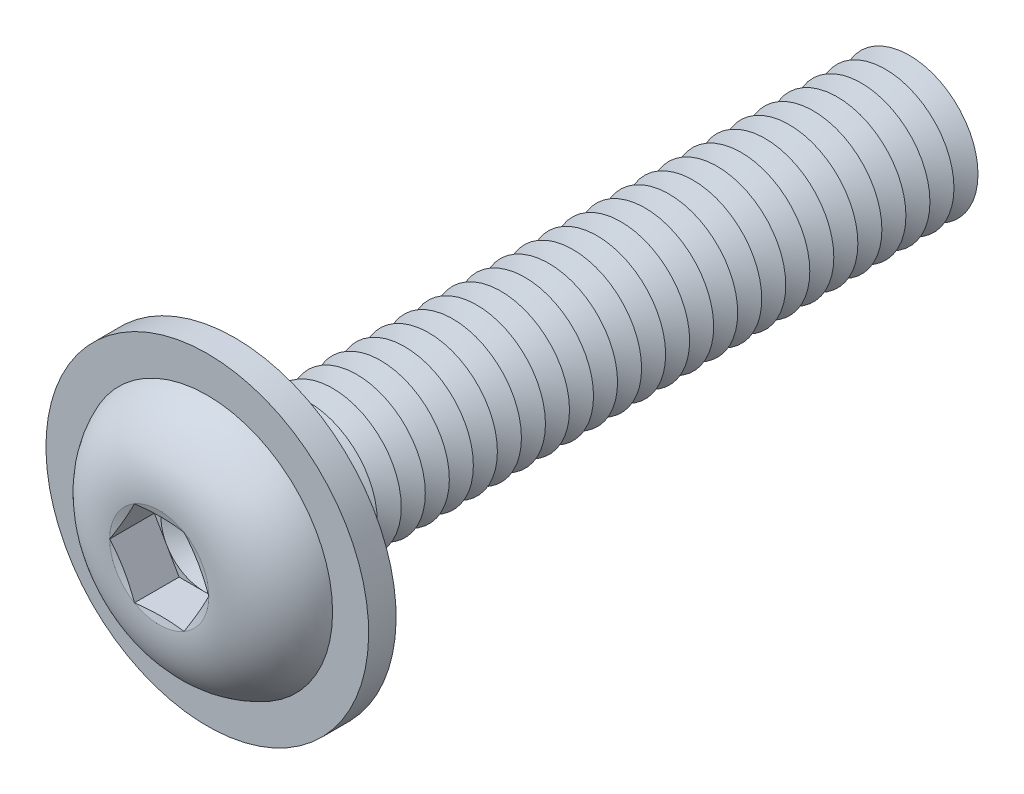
ISO-10303-21;
HEADER;
FILE_DESCRIPTION(('STEP AP214'),'2;1');
FILE_NAME('part.step','',(''),(''),'','','');
FILE_SCHEMA(('AUTOMOTIVE_DESIGN { 1 0 10303 214 1 1 1 1 }'));
ENDSEC;
DATA;
#1=APPLICATION_CONTEXT('core data for automotive mechanical design processes');
#2=APPLICATION_PROTOCOL_DEFINITION('international standard','automotive_design',2000,#1);
#3=PRODUCT_CONTEXT('',#1,'mechanical');
#4=PRODUCT('Part','Part','',(#3));
#5=PRODUCT_RELATED_PRODUCT_CATEGORY('part','',(#4));
#6=PRODUCT_DEFINITION_FORMATION('','',#4);
#7=PRODUCT_DEFINITION_CONTEXT('part definition',#1,'design');
#8=PRODUCT_DEFINITION('design','',#6,#7);
#9=PRODUCT_DEFINITION_SHAPE('','',#8);
#10=(LENGTH_UNIT() NAMED_UNIT(*) SI_UNIT(.MILLI.,.METRE.));
#11=(NAMED_UNIT(*) PLANE_ANGLE_UNIT() SI_UNIT($,.RADIAN.));
#12=(NAMED_UNIT(*) SI_UNIT($,.STERADIAN.) SOLID_ANGLE_UNIT());
#13=UNCERTAINTY_MEASURE_WITH_UNIT(LENGTH_MEASURE(1.E-05),#10,'distance_accuracy_value','');
#14=(GEOMETRIC_REPRESENTATION_CONTEXT(3) GLOBAL_UNCERTAINTY_ASSIGNED_CONTEXT((#13)) GLOBAL_UNIT_ASSIGNED_CONTEXT((#10,
#11,#12)) REPRESENTATION_CONTEXT('',''));
#15=CARTESIAN_POINT('',(0.,0.,0.));
#16=DIRECTION('',(0.,0.,1.));
#17=DIRECTION('',(1.,0.,0.));
#18=AXIS2_PLACEMENT_3D('',#15,#16,#17);
#19=CARTESIAN_POINT('',(0.,0.,-17.55));
#20=DIRECTION('',(0.,0.,1.));
#21=DIRECTION('',(1.,0.,0.));
#22=AXIS2_PLACEMENT_3D('',#19,#20,#21);
#23=CONICAL_SURFACE('',#22,2.,1.0471975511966);
#24=CARTESIAN_POINT('',(0.,0.,-17.9));
#25=DIRECTION('',(0.,0.,1.));
#26=DIRECTION('',(1.,0.,0.));
#27=AXIS2_PLACEMENT_3D('',#24,#25,#26);
#28=CIRCLE('',#27,1.3937822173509);
#29=CARTESIAN_POINT('',(1.3937822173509,0.,-17.9));
#30=VERTEX_POINT('',#29);
#31=EDGE_CURVE('E433',#30,#30,#28,.T.);
#32=ORIENTED_EDGE('',*,*,#31,.T.);
#33=EDGE_LOOP('',(#32));
#34=FACE_BOUND('',#33,.T.);
#35=CARTESIAN_POINT('',(0.,0.,-17.55));
#36=DIRECTION('',(0.,0.,1.));
#37=DIRECTION('',(1.,0.,0.));
#38=AXIS2_PLACEMENT_3D('',#35,#36,#37);
#39=CIRCLE('',#38,2.);
#40=CARTESIAN_POINT('',(2.,0.,-17.55));
#41=VERTEX_POINT('',#40);
#42=EDGE_CURVE('E429',#41,#41,#39,.T.);
#43=ORIENTED_EDGE('',*,*,#42,.F.);
#44=EDGE_LOOP('',(#43));
#45=FACE_BOUND('',#44,.T.);
#46=ADVANCED_FACE('F39',(#34,#45),#23,.T.);
#47=CARTESIAN_POINT('',(0.,0.,-17.9));
#48=DIRECTION('',(0.,0.,-1.));
#49=DIRECTION('',(-1.,0.,0.));
#50=AXIS2_PLACEMENT_3D('',#47,#48,#49);
#51=CONICAL_SURFACE('',#50,1.3937822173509,1.0471975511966);
#52=CARTESIAN_POINT('',(0.,0.,-18.25));
#53=DIRECTION('',(0.,0.,1.));
#54=DIRECTION('',(1.,0.,0.));
#55=AXIS2_PLACEMENT_3D('',#52,#53,#54);
#56=CIRCLE('',#55,2.);
#57=CARTESIAN_POINT('',(2.,0.,-18.25));
#58=VERTEX_POINT('',#57);
#59=EDGE_CURVE('E437',#58,#58,#56,.T.);
#60=ORIENTED_EDGE('',*,*,#59,.T.);
#61=EDGE_LOOP('',(#60));
#62=FACE_BOUND('',#61,.T.);
#63=ORIENTED_EDGE('',*,*,#31,.F.);
#64=EDGE_LOOP('',(#63));
#65=FACE_BOUND('',#64,.T.);
#66=ADVANCED_FACE('F574',(#62,#65),#51,.T.);
#67=CARTESIAN_POINT('',(0.,2.00000000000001,-20.));
#68=DIRECTION('',(0.,0.,-1.));
#69=DIRECTION('',(-1.,0.,0.));
#70=AXIS2_PLACEMENT_3D('',#67,#68,#69);
#71=PLANE('',#70);
#72=CARTESIAN_POINT('',(0.,0.,-20.));
#73=DIRECTION('',(0.,0.,1.));
#74=DIRECTION('',(1.,0.,0.));
#75=AXIS2_PLACEMENT_3D('',#72,#73,#74);
#76=CIRCLE('',#75,1.3937822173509);
#77=CARTESIAN_POINT('',(1.3937822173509,0.,-20.));
#78=VERTEX_POINT('',#77);
#79=EDGE_CURVE('E457',#78,#78,#76,.T.);
#80=ORIENTED_EDGE('',*,*,#79,.F.);
#81=EDGE_LOOP('',(#80));
#82=FACE_BOUND('',#81,.T.);
#83=ADVANCED_FACE('F580',(#82),#71,.T.);
#84=CARTESIAN_POINT('',(0.,0.,-19.65));
#85=DIRECTION('',(0.,0.,1.));
#86=DIRECTION('',(1.,0.,0.));
#87=AXIS2_PLACEMENT_3D('',#84,#85,#86);
#88=CONICAL_SURFACE('',#87,2.,1.0471975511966);
#89=ORIENTED_EDGE('',*,*,#79,.T.);
#90=EDGE_LOOP('',(#89));
#91=FACE_BOUND('',#90,.T.);
#92=CARTESIAN_POINT('',(0.,0.,-19.65));
#93=DIRECTION('',(0.,0.,1.));
#94=DIRECTION('',(1.,0.,0.));
#95=AXIS2_PLACEMENT_3D('',#92,#93,#94);
#96=CIRCLE('',#95,2.);
#97=CARTESIAN_POINT('',(2.,0.,-19.65));
#98=VERTEX_POINT('',#97);
#99=EDGE_CURVE('E453',#98,#98,#96,.T.);
#100=ORIENTED_EDGE('',*,*,#99,.F.);
#101=EDGE_LOOP('',(#100));
#102=FACE_BOUND('',#101,.T.);
#103=ADVANCED_FACE('F599',(#91,#102),#88,.T.);
#104=CARTESIAN_POINT('',(0.,0.,-19.3));
#105=DIRECTION('',(0.,0.,-1.));
#106=DIRECTION('',(-1.,0.,0.));
#107=AXIS2_PLACEMENT_3D('',#104,#105,#106);
#108=CONICAL_SURFACE('',#107,1.3937822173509,1.0471975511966);
#109=ORIENTED_EDGE('',*,*,#99,.T.);
#110=EDGE_LOOP('',(#109));
#111=FACE_BOUND('',#110,.T.);
#112=CARTESIAN_POINT('',(0.,0.,-19.3));
#113=DIRECTION('',(0.,0.,1.));
#114=DIRECTION('',(1.,0.,0.));
#115=AXIS2_PLACEMENT_3D('',#112,#113,#114);
#116=CIRCLE('',#115,1.3937822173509);
#117=CARTESIAN_POINT('',(1.3937822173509,0.,-19.3));
#118=VERTEX_POINT('',#117);
#119=EDGE_CURVE('E449',#118,#118,#116,.T.);
#120=ORIENTED_EDGE('',*,*,#119,.F.);
#121=EDGE_LOOP('',(#120));
#122=FACE_BOUND('',#121,.T.);
#123=ADVANCED_FACE('F596',(#111,#122),#108,.T.);
#124=CARTESIAN_POINT('',(0.,0.,-18.95));
#125=DIRECTION('',(0.,0.,1.));
#126=DIRECTION('',(1.,0.,0.));
#127=AXIS2_PLACEMENT_3D('',#124,#125,#126);
#128=CONICAL_SURFACE('',#127,2.,1.0471975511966);
#129=ORIENTED_EDGE('',*,*,#119,.T.);
#130=EDGE_LOOP('',(#129));
#131=FACE_BOUND('',#130,.T.);
#132=CARTESIAN_POINT('',(0.,0.,-18.95));
#133=DIRECTION('',(0.,0.,1.));
#134=DIRECTION('',(1.,0.,0.));
#135=AXIS2_PLACEMENT_3D('',#132,#133,#134);
#136=CIRCLE('',#135,2.);
#137=CARTESIAN_POINT('',(2.,0.,-18.95));
#138=VERTEX_POINT('',#137);
#139=EDGE_CURVE('E445',#138,#138,#136,.T.);
#140=ORIENTED_EDGE('',*,*,#139,.F.);
#141=EDGE_LOOP('',(#140));
#142=FACE_BOUND('',#141,.T.);
#143=ADVANCED_FACE('F590',(#131,#142),#128,.T.);
#144=CARTESIAN_POINT('',(0.,0.,-18.6));
#145=DIRECTION('',(0.,0.,-1.));
#146=DIRECTION('',(-1.,0.,0.));
#147=AXIS2_PLACEMENT_3D('',#144,#145,#146);
#148=CONICAL_SURFACE('',#147,1.3937822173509,1.0471975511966);
#149=ORIENTED_EDGE('',*,*,#139,.T.);
#150=EDGE_LOOP('',(#149));
#151=FACE_BOUND('',#150,.T.);
#152=CARTESIAN_POINT('',(0.,0.,-18.6));
#153=DIRECTION('',(0.,0.,1.));
#154=DIRECTION('',(1.,0.,0.));
#155=AXIS2_PLACEMENT_3D('',#152,#153,#154);
#156=CIRCLE('',#155,1.3937822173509);
#157=CARTESIAN_POINT('',(1.3937822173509,0.,-18.6));
#158=VERTEX_POINT('',#157);
#159=EDGE_CURVE('E441',#158,#158,#156,.T.);
#160=ORIENTED_EDGE('',*,*,#159,.F.);
#161=EDGE_LOOP('',(#160));
#162=FACE_BOUND('',#161,.T.);
#163=ADVANCED_FACE('F586',(#151,#162),#148,.T.);
#164=CARTESIAN_POINT('',(0.,0.,-18.25));
#165=DIRECTION('',(0.,0.,1.));
#166=DIRECTION('',(1.,0.,0.));
#167=AXIS2_PLACEMENT_3D('',#164,#165,#166);
#168=CONICAL_SURFACE('',#167,2.,1.0471975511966);
#169=ORIENTED_EDGE('',*,*,#159,.T.);
#170=EDGE_LOOP('',(#169));
#171=FACE_BOUND('',#170,.T.);
#172=ORIENTED_EDGE('',*,*,#59,.F.);
#173=EDGE_LOOP('',(#172));
#174=FACE_BOUND('',#173,.T.);
#175=ADVANCED_FACE('F589',(#171,#174),#168,.T.);
#176=CARTESIAN_POINT('',(0.,0.,-16.85));
#177=DIRECTION('',(0.,0.,1.));
#178=DIRECTION('',(1.,0.,0.));
#179=AXIS2_PLACEMENT_3D('',#176,#177,#178);
#180=CONICAL_SURFACE('',#179,2.,1.0471975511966);
#181=CARTESIAN_POINT('',(0.,0.,-17.2));
#182=DIRECTION('',(0.,0.,1.));
#183=DIRECTION('',(1.,0.,0.));
#184=AXIS2_PLACEMENT_3D('',#181,#182,#183);
#185=CIRCLE('',#184,1.3937822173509);
#186=CARTESIAN_POINT('',(1.3937822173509,0.,-17.2));
#187=VERTEX_POINT('',#186);
#188=EDGE_CURVE('E425',#187,#187,#185,.T.);
#189=ORIENTED_EDGE('',*,*,#188,.T.);
#190=EDGE_LOOP('',(#189));
#191=FACE_BOUND('',#190,.T.);
#192=CARTESIAN_POINT('',(0.,0.,-16.85));
#193=DIRECTION('',(0.,0.,1.));
#194=DIRECTION('',(1.,0.,0.));
#195=AXIS2_PLACEMENT_3D('',#192,#193,#194);
#196=CIRCLE('',#195,2.);
#197=CARTESIAN_POINT('',(2.,0.,-16.85));
#198=VERTEX_POINT('',#197);
#199=EDGE_CURVE('E421',#198,#198,#196,.T.);
#200=ORIENTED_EDGE('',*,*,#199,.F.);
#201=EDGE_LOOP('',(#200));
#202=FACE_BOUND('',#201,.T.);
#203=ADVANCED_FACE('F594',(#191,#202),#180,.T.);
#204=CARTESIAN_POINT('',(0.,0.,-17.2));
#205=DIRECTION('',(0.,0.,-1.));
#206=DIRECTION('',(-1.,0.,0.));
#207=AXIS2_PLACEMENT_3D('',#204,#205,#206);
#208=CONICAL_SURFACE('',#207,1.3937822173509,1.0471975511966);
#209=ORIENTED_EDGE('',*,*,#42,.T.);
#210=EDGE_LOOP('',(#209));
#211=FACE_BOUND('',#210,.T.);
#212=ORIENTED_EDGE('',*,*,#188,.F.);
#213=EDGE_LOOP('',(#212));
#214=FACE_BOUND('',#213,.T.);
#215=ADVANCED_FACE('F645',(#211,#214),#208,.T.);
#216=CARTESIAN_POINT('',(0.,0.,-16.15));
#217=DIRECTION('',(0.,0.,1.));
#218=DIRECTION('',(1.,0.,0.));
#219=AXIS2_PLACEMENT_3D('',#216,#217,#218);
#220=CONICAL_SURFACE('',#219,2.,1.0471975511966);
#221=CARTESIAN_POINT('',(0.,0.,-16.5));
#222=DIRECTION('',(0.,0.,1.));
#223=DIRECTION('',(1.,0.,0.));
#224=AXIS2_PLACEMENT_3D('',#221,#222,#223);
#225=CIRCLE('',#224,1.3937822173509);
#226=CARTESIAN_POINT('',(1.3937822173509,0.,-16.5));
#227=VERTEX_POINT('',#226);
#228=EDGE_CURVE('E417',#227,#227,#225,.T.);
#229=ORIENTED_EDGE('',*,*,#228,.T.);
#230=EDGE_LOOP('',(#229));
#231=FACE_BOUND('',#230,.T.);
#232=CARTESIAN_POINT('',(0.,0.,-16.15));
#233=DIRECTION('',(0.,0.,1.));
#234=DIRECTION('',(1.,0.,0.));
#235=AXIS2_PLACEMENT_3D('',#232,#233,#234);
#236=CIRCLE('',#235,2.);
#237=CARTESIAN_POINT('',(2.,0.,-16.15));
#238=VERTEX_POINT('',#237);
#239=EDGE_CURVE('E413',#238,#238,#236,.T.);
#240=ORIENTED_EDGE('',*,*,#239,.F.);
#241=EDGE_LOOP('',(#240));
#242=FACE_BOUND('',#241,.T.);
#243=ADVANCED_FACE('F651',(#231,#242),#220,.T.);
#244=CARTESIAN_POINT('',(0.,0.,-16.5));
#245=DIRECTION('',(0.,0.,-1.));
#246=DIRECTION('',(-1.,0.,0.));
#247=AXIS2_PLACEMENT_3D('',#244,#245,#246);
#248=CONICAL_SURFACE('',#247,1.3937822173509,1.0471975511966);
#249=ORIENTED_EDGE('',*,*,#199,.T.);
#250=EDGE_LOOP('',(#249));
#251=FACE_BOUND('',#250,.T.);
#252=ORIENTED_EDGE('',*,*,#228,.F.);
#253=EDGE_LOOP('',(#252));
#254=FACE_BOUND('',#253,.T.);
#255=ADVANCED_FACE('F658',(#251,#254),#248,.T.);
#256=CARTESIAN_POINT('',(0.,0.,-15.45));
#257=DIRECTION('',(0.,0.,1.));
#258=DIRECTION('',(1.,0.,0.));
#259=AXIS2_PLACEMENT_3D('',#256,#257,#258);
#260=CONICAL_SURFACE('',#259,2.,1.0471975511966);
#261=CARTESIAN_POINT('',(0.,0.,-15.8));
#262=DIRECTION('',(0.,0.,1.));
#263=DIRECTION('',(1.,0.,0.));
#264=AXIS2_PLACEMENT_3D('',#261,#262,#263);
#265=CIRCLE('',#264,1.3937822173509);
#266=CARTESIAN_POINT('',(1.3937822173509,0.,-15.8));
#267=VERTEX_POINT('',#266);
#268=EDGE_CURVE('E409',#267,#267,#265,.T.);
#269=ORIENTED_EDGE('',*,*,#268,.T.);
#270=EDGE_LOOP('',(#269));
#271=FACE_BOUND('',#270,.T.);
#272=CARTESIAN_POINT('',(0.,0.,-15.45));
#273=DIRECTION('',(0.,0.,1.));
#274=DIRECTION('',(1.,0.,0.));
#275=AXIS2_PLACEMENT_3D('',#272,#273,#274);
#276=CIRCLE('',#275,2.);
#277=CARTESIAN_POINT('',(2.,0.,-15.45));
#278=VERTEX_POINT('',#277);
#279=EDGE_CURVE('E405',#278,#278,#276,.T.);
#280=ORIENTED_EDGE('',*,*,#279,.F.);
#281=EDGE_LOOP('',(#280));
#282=FACE_BOUND('',#281,.T.);
#283=ADVANCED_FACE('F665',(#271,#282),#260,.T.);
#284=CARTESIAN_POINT('',(0.,0.,-15.8));
#285=DIRECTION('',(0.,0.,-1.));
#286=DIRECTION('',(-1.,0.,0.));
#287=AXIS2_PLACEMENT_3D('',#284,#285,#286);
#288=CONICAL_SURFACE('',#287,1.3937822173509,1.0471975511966);
#289=ORIENTED_EDGE('',*,*,#239,.T.);
#290=EDGE_LOOP('',(#289));
#291=FACE_BOUND('',#290,.T.);
#292=ORIENTED_EDGE('',*,*,#268,.F.);
#293=EDGE_LOOP('',(#292));
#294=FACE_BOUND('',#293,.T.);
#295=ADVANCED_FACE('F672',(#291,#294),#288,.T.);
#296=CARTESIAN_POINT('',(0.,0.,-14.75));
#297=DIRECTION('',(0.,0.,1.));
#298=DIRECTION('',(1.,0.,0.));
#299=AXIS2_PLACEMENT_3D('',#296,#297,#298);
#300=CONICAL_SURFACE('',#299,2.,1.0471975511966);
#301=CARTESIAN_POINT('',(0.,0.,-15.1));
#302=DIRECTION('',(0.,0.,1.));
#303=DIRECTION('',(1.,0.,0.));
#304=AXIS2_PLACEMENT_3D('',#301,#302,#303);
#305=CIRCLE('',#304,1.3937822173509);
#306=CARTESIAN_POINT('',(1.3937822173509,0.,-15.1));
#307=VERTEX_POINT('',#306);
#308=EDGE_CURVE('E401',#307,#307,#305,.T.);
#309=ORIENTED_EDGE('',*,*,#308,.T.);
#310=EDGE_LOOP('',(#309));
#311=FACE_BOUND('',#310,.T.);
#312=CARTESIAN_POINT('',(0.,0.,-14.75));
#313=DIRECTION('',(0.,0.,1.));
#314=DIRECTION('',(1.,0.,0.));
#315=AXIS2_PLACEMENT_3D('',#312,#313,#314);
#316=CIRCLE('',#315,2.);
#317=CARTESIAN_POINT('',(2.,0.,-14.75));
#318=VERTEX_POINT('',#317);
#319=EDGE_CURVE('E397',#318,#318,#316,.T.);
#320=ORIENTED_EDGE('',*,*,#319,.F.);
#321=EDGE_LOOP('',(#320));
#322=FACE_BOUND('',#321,.T.);
#323=ADVANCED_FACE('F679',(#311,#322),#300,.T.);
#324=CARTESIAN_POINT('',(0.,0.,-15.1));
#325=DIRECTION('',(0.,0.,-1.));
#326=DIRECTION('',(-1.,0.,0.));
#327=AXIS2_PLACEMENT_3D('',#324,#325,#326);
#328=CONICAL_SURFACE('',#327,1.3937822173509,1.0471975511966);
#329=ORIENTED_EDGE('',*,*,#279,.T.);
#330=EDGE_LOOP('',(#329));
#331=FACE_BOUND('',#330,.T.);
#332=ORIENTED_EDGE('',*,*,#308,.F.);
#333=EDGE_LOOP('',(#332));
#334=FACE_BOUND('',#333,.T.);
#335=ADVANCED_FACE('F686',(#331,#334),#328,.T.);
#336=CARTESIAN_POINT('',(0.,0.,-14.05));
#337=DIRECTION('',(0.,0.,1.));
#338=DIRECTION('',(1.,0.,0.));
#339=AXIS2_PLACEMENT_3D('',#336,#337,#338);
#340=CONICAL_SURFACE('',#339,2.,1.0471975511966);
#341=CARTESIAN_POINT('',(0.,0.,-14.4));
#342=DIRECTION('',(0.,0.,1.));
#343=DIRECTION('',(1.,0.,0.));
#344=AXIS2_PLACEMENT_3D('',#341,#342,#343);
#345=CIRCLE('',#344,1.3937822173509);
#346=CARTESIAN_POINT('',(1.3937822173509,0.,-14.4));
#347=VERTEX_POINT('',#346);
#348=EDGE_CURVE('E393',#347,#347,#345,.T.);
#349=ORIENTED_EDGE('',*,*,#348,.T.);
#350=EDGE_LOOP('',(#349));
#351=FACE_BOUND('',#350,.T.);
#352=CARTESIAN_POINT('',(0.,0.,-14.05));
#353=DIRECTION('',(0.,0.,1.));
#354=DIRECTION('',(1.,0.,0.));
#355=AXIS2_PLACEMENT_3D('',#352,#353,#354);
#356=CIRCLE('',#355,2.);
#357=CARTESIAN_POINT('',(2.,0.,-14.05));
#358=VERTEX_POINT('',#357);
#359=EDGE_CURVE('E389',#358,#358,#356,.T.);
#360=ORIENTED_EDGE('',*,*,#359,.F.);
#361=EDGE_LOOP('',(#360));
#362=FACE_BOUND('',#361,.T.);
#363=ADVANCED_FACE('F693',(#351,#362),#340,.T.);
#364=CARTESIAN_POINT('',(0.,0.,-14.4));
#365=DIRECTION('',(0.,0.,-1.));
#366=DIRECTION('',(-1.,0.,0.));
#367=AXIS2_PLACEMENT_3D('',#364,#365,#366);
#368=CONICAL_SURFACE('',#367,1.3937822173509,1.0471975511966);
#369=ORIENTED_EDGE('',*,*,#319,.T.);
#370=EDGE_LOOP('',(#369));
#371=FACE_BOUND('',#370,.T.);
#372=ORIENTED_EDGE('',*,*,#348,.F.);
#373=EDGE_LOOP('',(#372));
#374=FACE_BOUND('',#373,.T.);
#375=ADVANCED_FACE('F700',(#371,#374),#368,.T.);
#376=CARTESIAN_POINT('',(0.,0.,-13.35));
#377=DIRECTION('',(0.,0.,1.));
#378=DIRECTION('',(1.,0.,0.));
#379=AXIS2_PLACEMENT_3D('',#376,#377,#378);
#380=CONICAL_SURFACE('',#379,2.,1.0471975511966);
#381=CARTESIAN_POINT('',(0.,0.,-13.7));
#382=DIRECTION('',(0.,0.,1.));
#383=DIRECTION('',(1.,0.,0.));
#384=AXIS2_PLACEMENT_3D('',#381,#382,#383);
#385=CIRCLE('',#384,1.3937822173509);
#386=CARTESIAN_POINT('',(1.3937822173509,0.,-13.7));
#387=VERTEX_POINT('',#386);
#388=EDGE_CURVE('E385',#387,#387,#385,.T.);
#389=ORIENTED_EDGE('',*,*,#388,.T.);
#390=EDGE_LOOP('',(#389));
#391=FACE_BOUND('',#390,.T.);
#392=CARTESIAN_POINT('',(0.,0.,-13.35));
#393=DIRECTION('',(0.,0.,1.));
#394=DIRECTION('',(1.,0.,0.));
#395=AXIS2_PLACEMENT_3D('',#392,#393,#394);
#396=CIRCLE('',#395,2.);
#397=CARTESIAN_POINT('',(2.,0.,-13.35));
#398=VERTEX_POINT('',#397);
#399=EDGE_CURVE('E381',#398,#398,#396,.T.);
#400=ORIENTED_EDGE('',*,*,#399,.F.);
#401=EDGE_LOOP('',(#400));
#402=FACE_BOUND('',#401,.T.);
#403=ADVANCED_FACE('F707',(#391,#402),#380,.T.);
#404=CARTESIAN_POINT('',(0.,0.,-13.7));
#405=DIRECTION('',(0.,0.,-1.));
#406=DIRECTION('',(-1.,0.,0.));
#407=AXIS2_PLACEMENT_3D('',#404,#405,#406);
#408=CONICAL_SURFACE('',#407,1.3937822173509,1.0471975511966);
#409=ORIENTED_EDGE('',*,*,#359,.T.);
#410=EDGE_LOOP('',(#409));
#411=FACE_BOUND('',#410,.T.);
#412=ORIENTED_EDGE('',*,*,#388,.F.);
#413=EDGE_LOOP('',(#412));
#414=FACE_BOUND('',#413,.T.);
#415=ADVANCED_FACE('F714',(#411,#414),#408,.T.);
#416=CARTESIAN_POINT('',(0.,0.,-12.65));
#417=DIRECTION('',(0.,0.,1.));
#418=DIRECTION('',(1.,0.,0.));
#419=AXIS2_PLACEMENT_3D('',#416,#417,#418);
#420=CONICAL_SURFACE('',#419,2.,1.0471975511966);
#421=CARTESIAN_POINT('',(0.,0.,-13.));
#422=DIRECTION('',(0.,0.,1.));
#423=DIRECTION('',(1.,0.,0.));
#424=AXIS2_PLACEMENT_3D('',#421,#422,#423);
#425=CIRCLE('',#424,1.3937822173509);
#426=CARTESIAN_POINT('',(1.3937822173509,0.,-13.));
#427=VERTEX_POINT('',#426);
#428=EDGE_CURVE('E377',#427,#427,#425,.T.);
#429=ORIENTED_EDGE('',*,*,#428,.T.);
#430=EDGE_LOOP('',(#429));
#431=FACE_BOUND('',#430,.T.);
#432=CARTESIAN_POINT('',(0.,0.,-12.65));
#433=DIRECTION('',(0.,0.,1.));
#434=DIRECTION('',(1.,0.,0.));
#435=AXIS2_PLACEMENT_3D('',#432,#433,#434);
#436=CIRCLE('',#435,2.);
#437=CARTESIAN_POINT('',(2.,0.,-12.65));
#438=VERTEX_POINT('',#437);
#439=EDGE_CURVE('E373',#438,#438,#436,.T.);
#440=ORIENTED_EDGE('',*,*,#439,.F.);
#441=EDGE_LOOP('',(#440));
#442=FACE_BOUND('',#441,.T.);
#443=ADVANCED_FACE('F721',(#431,#442),#420,.T.);
#444=CARTESIAN_POINT('',(0.,0.,-13.));
#445=DIRECTION('',(0.,0.,-1.));
#446=DIRECTION('',(-1.,0.,0.));
#447=AXIS2_PLACEMENT_3D('',#444,#445,#446);
#448=CONICAL_SURFACE('',#447,1.3937822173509,1.0471975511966);
#449=ORIENTED_EDGE('',*,*,#399,.T.);
#450=EDGE_LOOP('',(#449));
#451=FACE_BOUND('',#450,.T.);
#452=ORIENTED_EDGE('',*,*,#428,.F.);
#453=EDGE_LOOP('',(#452));
#454=FACE_BOUND('',#453,.T.);
#455=ADVANCED_FACE('F728',(#451,#454),#448,.T.);
#456=CARTESIAN_POINT('',(0.,0.,-11.95));
#457=DIRECTION('',(0.,0.,1.));
#458=DIRECTION('',(1.,0.,0.));
#459=AXIS2_PLACEMENT_3D('',#456,#457,#458);
#460=CONICAL_SURFACE('',#459,2.,1.0471975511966);
#461=CARTESIAN_POINT('',(0.,0.,-12.3));
#462=DIRECTION('',(0.,0.,1.));
#463=DIRECTION('',(1.,0.,0.));
#464=AXIS2_PLACEMENT_3D('',#461,#462,#463);
#465=CIRCLE('',#464,1.3937822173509);
#466=CARTESIAN_POINT('',(1.3937822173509,0.,-12.3));
#467=VERTEX_POINT('',#466);
#468=EDGE_CURVE('E369',#467,#467,#465,.T.);
#469=ORIENTED_EDGE('',*,*,#468,.T.);
#470=EDGE_LOOP('',(#469));
#471=FACE_BOUND('',#470,.T.);
#472=CARTESIAN_POINT('',(0.,0.,-11.95));
#473=DIRECTION('',(0.,0.,1.));
#474=DIRECTION('',(1.,0.,0.));
#475=AXIS2_PLACEMENT_3D('',#472,#473,#474);
#476=CIRCLE('',#475,2.);
#477=CARTESIAN_POINT('',(2.,0.,-11.95));
#478=VERTEX_POINT('',#477);
#479=EDGE_CURVE('E365',#478,#478,#476,.T.);
#480=ORIENTED_EDGE('',*,*,#479,.F.);
#481=EDGE_LOOP('',(#480));
#482=FACE_BOUND('',#481,.T.);
#483=ADVANCED_FACE('F735',(#471,#482),#460,.T.);
#484=CARTESIAN_POINT('',(0.,0.,-12.3));
#485=DIRECTION('',(0.,0.,-1.));
#486=DIRECTION('',(-1.,0.,0.));
#487=AXIS2_PLACEMENT_3D('',#484,#485,#486);
#488=CONICAL_SURFACE('',#487,1.3937822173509,1.0471975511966);
#489=ORIENTED_EDGE('',*,*,#439,.T.);
#490=EDGE_LOOP('',(#489));
#491=FACE_BOUND('',#490,.T.);
#492=ORIENTED_EDGE('',*,*,#468,.F.);
#493=EDGE_LOOP('',(#492));
#494=FACE_BOUND('',#493,.T.);
#495=ADVANCED_FACE('F742',(#491,#494),#488,.T.);
#496=CARTESIAN_POINT('',(0.,0.,-11.25));
#497=DIRECTION('',(0.,0.,1.));
#498=DIRECTION('',(1.,0.,0.));
#499=AXIS2_PLACEMENT_3D('',#496,#497,#498);
#500=CONICAL_SURFACE('',#499,2.,1.0471975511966);
#501=CARTESIAN_POINT('',(0.,0.,-11.6));
#502=DIRECTION('',(0.,0.,1.));
#503=DIRECTION('',(1.,0.,0.));
#504=AXIS2_PLACEMENT_3D('',#501,#502,#503);
#505=CIRCLE('',#504,1.3937822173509);
#506=CARTESIAN_POINT('',(1.3937822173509,0.,-11.6));
#507=VERTEX_POINT('',#506);
#508=EDGE_CURVE('E361',#507,#507,#505,.T.);
#509=ORIENTED_EDGE('',*,*,#508,.T.);
#510=EDGE_LOOP('',(#509));
#511=FACE_BOUND('',#510,.T.);
#512=CARTESIAN_POINT('',(0.,0.,-11.25));
#513=DIRECTION('',(0.,0.,1.));
#514=DIRECTION('',(1.,0.,0.));
#515=AXIS2_PLACEMENT_3D('',#512,#513,#514);
#516=CIRCLE('',#515,2.);
#517=CARTESIAN_POINT('',(2.,0.,-11.25));
#518=VERTEX_POINT('',#517);
#519=EDGE_CURVE('E357',#518,#518,#516,.T.);
#520=ORIENTED_EDGE('',*,*,#519,.F.);
#521=EDGE_LOOP('',(#520));
#522=FACE_BOUND('',#521,.T.);
#523=ADVANCED_FACE('F749',(#511,#522),#500,.T.);
#524=CARTESIAN_POINT('',(0.,0.,-11.6));
#525=DIRECTION('',(0.,0.,-1.));
#526=DIRECTION('',(-1.,0.,0.));
#527=AXIS2_PLACEMENT_3D('',#524,#525,#526);
#528=CONICAL_SURFACE('',#527,1.3937822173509,1.0471975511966);
#529=ORIENTED_EDGE('',*,*,#479,.T.);
#530=EDGE_LOOP('',(#529));
#531=FACE_BOUND('',#530,.T.);
#532=ORIENTED_EDGE('',*,*,#508,.F.);
#533=EDGE_LOOP('',(#532));
#534=FACE_BOUND('',#533,.T.);
#535=ADVANCED_FACE('F756',(#531,#534),#528,.T.);
#536=CARTESIAN_POINT('',(0.,0.,-10.55));
#537=DIRECTION('',(0.,0.,1.));
#538=DIRECTION('',(1.,0.,0.));
#539=AXIS2_PLACEMENT_3D('',#536,#537,#538);
#540=CONICAL_SURFACE('',#539,2.,1.0471975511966);
#541=CARTESIAN_POINT('',(0.,0.,-10.9));
#542=DIRECTION('',(0.,0.,1.));
#543=DIRECTION('',(1.,0.,0.));
#544=AXIS2_PLACEMENT_3D('',#541,#542,#543);
#545=CIRCLE('',#544,1.3937822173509);
#546=CARTESIAN_POINT('',(1.3937822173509,0.,-10.9));
#547=VERTEX_POINT('',#546);
#548=EDGE_CURVE('E353',#547,#547,#545,.T.);
#549=ORIENTED_EDGE('',*,*,#548,.T.);
#550=EDGE_LOOP('',(#549));
#551=FACE_BOUND('',#550,.T.);
#552=CARTESIAN_POINT('',(0.,0.,-10.55));
#553=DIRECTION('',(0.,0.,1.));
#554=DIRECTION('',(1.,0.,0.));
#555=AXIS2_PLACEMENT_3D('',#552,#553,#554);
#556=CIRCLE('',#555,2.);
#557=CARTESIAN_POINT('',(2.,0.,-10.55));
#558=VERTEX_POINT('',#557);
#559=EDGE_CURVE('E349',#558,#558,#556,.T.);
#560=ORIENTED_EDGE('',*,*,#559,.F.);
#561=EDGE_LOOP('',(#560));
#562=FACE_BOUND('',#561,.T.);
#563=ADVANCED_FACE('F763',(#551,#562),#540,.T.);
#564=CARTESIAN_POINT('',(0.,0.,-10.9));
#565=DIRECTION('',(0.,0.,-1.));
#566=DIRECTION('',(-1.,0.,0.));
#567=AXIS2_PLACEMENT_3D('',#564,#565,#566);
#568=CONICAL_SURFACE('',#567,1.3937822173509,1.0471975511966);
#569=ORIENTED_EDGE('',*,*,#519,.T.);
#570=EDGE_LOOP('',(#569));
#571=FACE_BOUND('',#570,.T.);
#572=ORIENTED_EDGE('',*,*,#548,.F.);
#573=EDGE_LOOP('',(#572));
#574=FACE_BOUND('',#573,.T.);
#575=ADVANCED_FACE('F770',(#571,#574),#568,.T.);
#576=CARTESIAN_POINT('',(0.,0.,-9.85));
#577=DIRECTION('',(0.,0.,1.));
#578=DIRECTION('',(1.,0.,0.));
#579=AXIS2_PLACEMENT_3D('',#576,#577,#578);
#580=CONICAL_SURFACE('',#579,2.,1.0471975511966);
#581=CARTESIAN_POINT('',(0.,0.,-10.2));
#582=DIRECTION('',(0.,0.,1.));
#583=DIRECTION('',(1.,0.,0.));
#584=AXIS2_PLACEMENT_3D('',#581,#582,#583);
#585=CIRCLE('',#584,1.3937822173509);
#586=CARTESIAN_POINT('',(1.3937822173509,0.,-10.2));
#587=VERTEX_POINT('',#586);
#588=EDGE_CURVE('E345',#587,#587,#585,.T.);
#589=ORIENTED_EDGE('',*,*,#588,.T.);
#590=EDGE_LOOP('',(#589));
#591=FACE_BOUND('',#590,.T.);
#592=CARTESIAN_POINT('',(0.,0.,-9.85));
#593=DIRECTION('',(0.,0.,1.));
#594=DIRECTION('',(1.,0.,0.));
#595=AXIS2_PLACEMENT_3D('',#592,#593,#594);
#596=CIRCLE('',#595,2.);
#597=CARTESIAN_POINT('',(2.,0.,-9.85));
#598=VERTEX_POINT('',#597);
#599=EDGE_CURVE('E341',#598,#598,#596,.T.);
#600=ORIENTED_EDGE('',*,*,#599,.F.);
#601=EDGE_LOOP('',(#600));
#602=FACE_BOUND('',#601,.T.);
#603=ADVANCED_FACE('F777',(#591,#602),#580,.T.);
#604=CARTESIAN_POINT('',(0.,0.,-10.2));
#605=DIRECTION('',(0.,0.,-1.));
#606=DIRECTION('',(-1.,0.,0.));
#607=AXIS2_PLACEMENT_3D('',#604,#605,#606);
#608=CONICAL_SURFACE('',#607,1.3937822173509,1.0471975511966);
#609=ORIENTED_EDGE('',*,*,#559,.T.);
#610=EDGE_LOOP('',(#609));
#611=FACE_BOUND('',#610,.T.);
#612=ORIENTED_EDGE('',*,*,#588,.F.);
#613=EDGE_LOOP('',(#612));
#614=FACE_BOUND('',#613,.T.);
#615=ADVANCED_FACE('F784',(#611,#614),#608,.T.);
#616=CARTESIAN_POINT('',(0.,0.,-9.15));
#617=DIRECTION('',(0.,0.,1.));
#618=DIRECTION('',(1.,0.,0.));
#619=AXIS2_PLACEMENT_3D('',#616,#617,#618);
#620=CONICAL_SURFACE('',#619,2.,1.0471975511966);
#621=CARTESIAN_POINT('',(0.,0.,-9.5));
#622=DIRECTION('',(0.,0.,1.));
#623=DIRECTION('',(1.,0.,0.));
#624=AXIS2_PLACEMENT_3D('',#621,#622,#623);
#625=CIRCLE('',#624,1.3937822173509);
#626=CARTESIAN_POINT('',(1.3937822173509,0.,-9.5));
#627=VERTEX_POINT('',#626);
#628=EDGE_CURVE('E337',#627,#627,#625,.T.);
#629=ORIENTED_EDGE('',*,*,#628,.T.);
#630=EDGE_LOOP('',(#629));
#631=FACE_BOUND('',#630,.T.);
#632=CARTESIAN_POINT('',(0.,0.,-9.15));
#633=DIRECTION('',(0.,0.,1.));
#634=DIRECTION('',(1.,0.,0.));
#635=AXIS2_PLACEMENT_3D('',#632,#633,#634);
#636=CIRCLE('',#635,2.);
#637=CARTESIAN_POINT('',(2.,0.,-9.15));
#638=VERTEX_POINT('',#637);
#639=EDGE_CURVE('E333',#638,#638,#636,.T.);
#640=ORIENTED_EDGE('',*,*,#639,.F.);
#641=EDGE_LOOP('',(#640));
#642=FACE_BOUND('',#641,.T.);
#643=ADVANCED_FACE('F791',(#631,#642),#620,.T.);
#644=CARTESIAN_POINT('',(0.,0.,-9.5));
#645=DIRECTION('',(0.,0.,-1.));
#646=DIRECTION('',(-1.,0.,0.));
#647=AXIS2_PLACEMENT_3D('',#644,#645,#646);
#648=CONICAL_SURFACE('',#647,1.3937822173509,1.0471975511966);
#649=ORIENTED_EDGE('',*,*,#599,.T.);
#650=EDGE_LOOP('',(#649));
#651=FACE_BOUND('',#650,.T.);
#652=ORIENTED_EDGE('',*,*,#628,.F.);
#653=EDGE_LOOP('',(#652));
#654=FACE_BOUND('',#653,.T.);
#655=ADVANCED_FACE('F798',(#651,#654),#648,.T.);
#656=CARTESIAN_POINT('',(0.,0.,-8.45));
#657=DIRECTION('',(0.,0.,1.));
#658=DIRECTION('',(1.,0.,0.));
#659=AXIS2_PLACEMENT_3D('',#656,#657,#658);
#660=CONICAL_SURFACE('',#659,2.,1.0471975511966);
#661=CARTESIAN_POINT('',(0.,0.,-8.8));
#662=DIRECTION('',(0.,0.,1.));
#663=DIRECTION('',(1.,0.,0.));
#664=AXIS2_PLACEMENT_3D('',#661,#662,#663);
#665=CIRCLE('',#664,1.3937822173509);
#666=CARTESIAN_POINT('',(1.3937822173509,0.,-8.8));
#667=VERTEX_POINT('',#666);
#668=EDGE_CURVE('E329',#667,#667,#665,.T.);
#669=ORIENTED_EDGE('',*,*,#668,.T.);
#670=EDGE_LOOP('',(#669));
#671=FACE_BOUND('',#670,.T.);
#672=CARTESIAN_POINT('',(0.,0.,-8.45));
#673=DIRECTION('',(0.,0.,1.));
#674=DIRECTION('',(1.,0.,0.));
#675=AXIS2_PLACEMENT_3D('',#672,#673,#674);
#676=CIRCLE('',#675,2.);
#677=CARTESIAN_POINT('',(2.,0.,-8.45));
#678=VERTEX_POINT('',#677);
#679=EDGE_CURVE('E325',#678,#678,#676,.T.);
#680=ORIENTED_EDGE('',*,*,#679,.F.);
#681=EDGE_LOOP('',(#680));
#682=FACE_BOUND('',#681,.T.);
#683=ADVANCED_FACE('F805',(#671,#682),#660,.T.);
#684=CARTESIAN_POINT('',(0.,0.,-8.8));
#685=DIRECTION('',(0.,0.,-1.));
#686=DIRECTION('',(-1.,0.,0.));
#687=AXIS2_PLACEMENT_3D('',#684,#685,#686);
#688=CONICAL_SURFACE('',#687,1.3937822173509,1.0471975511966);
#689=ORIENTED_EDGE('',*,*,#639,.T.);
#690=EDGE_LOOP('',(#689));
#691=FACE_BOUND('',#690,.T.);
#692=ORIENTED_EDGE('',*,*,#668,.F.);
#693=EDGE_LOOP('',(#692));
#694=FACE_BOUND('',#693,.T.);
#695=ADVANCED_FACE('F812',(#691,#694),#688,.T.);
#696=CARTESIAN_POINT('',(0.,0.,-7.75));
#697=DIRECTION('',(0.,0.,1.));
#698=DIRECTION('',(1.,0.,0.));
#699=AXIS2_PLACEMENT_3D('',#696,#697,#698);
#700=CONICAL_SURFACE('',#699,2.,1.0471975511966);
#701=CARTESIAN_POINT('',(0.,0.,-8.1));
#702=DIRECTION('',(0.,0.,1.));
#703=DIRECTION('',(1.,0.,0.));
#704=AXIS2_PLACEMENT_3D('',#701,#702,#703);
#705=CIRCLE('',#704,1.3937822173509);
#706=CARTESIAN_POINT('',(1.3937822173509,0.,-8.1));
#707=VERTEX_POINT('',#706);
#708=EDGE_CURVE('E321',#707,#707,#705,.T.);
#709=ORIENTED_EDGE('',*,*,#708,.T.);
#710=EDGE_LOOP('',(#709));
#711=FACE_BOUND('',#710,.T.);
#712=CARTESIAN_POINT('',(0.,0.,-7.75));
#713=DIRECTION('',(0.,0.,1.));
#714=DIRECTION('',(1.,0.,0.));
#715=AXIS2_PLACEMENT_3D('',#712,#713,#714);
#716=CIRCLE('',#715,2.);
#717=CARTESIAN_POINT('',(2.,0.,-7.75));
#718=VERTEX_POINT('',#717);
#719=EDGE_CURVE('E317',#718,#718,#716,.T.);
#720=ORIENTED_EDGE('',*,*,#719,.F.);
#721=EDGE_LOOP('',(#720));
#722=FACE_BOUND('',#721,.T.);
#723=ADVANCED_FACE('F819',(#711,#722),#700,.T.);
#724=CARTESIAN_POINT('',(0.,0.,-8.1));
#725=DIRECTION('',(0.,0.,-1.));
#726=DIRECTION('',(-1.,0.,0.));
#727=AXIS2_PLACEMENT_3D('',#724,#725,#726);
#728=CONICAL_SURFACE('',#727,1.3937822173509,1.0471975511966);
#729=ORIENTED_EDGE('',*,*,#679,.T.);
#730=EDGE_LOOP('',(#729));
#731=FACE_BOUND('',#730,.T.);
#732=ORIENTED_EDGE('',*,*,#708,.F.);
#733=EDGE_LOOP('',(#732));
#734=FACE_BOUND('',#733,.T.);
#735=ADVANCED_FACE('F826',(#731,#734),#728,.T.);
#736=CARTESIAN_POINT('',(0.,0.,-7.05));
#737=DIRECTION('',(0.,0.,1.));
#738=DIRECTION('',(1.,0.,0.));
#739=AXIS2_PLACEMENT_3D('',#736,#737,#738);
#740=CONICAL_SURFACE('',#739,2.,1.0471975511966);
#741=CARTESIAN_POINT('',(0.,0.,-7.4));
#742=DIRECTION('',(0.,0.,1.));
#743=DIRECTION('',(1.,0.,0.));
#744=AXIS2_PLACEMENT_3D('',#741,#742,#743);
#745=CIRCLE('',#744,1.3937822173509);
#746=CARTESIAN_POINT('',(1.3937822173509,0.,-7.4));
#747=VERTEX_POINT('',#746);
#748=EDGE_CURVE('E313',#747,#747,#745,.T.);
#749=ORIENTED_EDGE('',*,*,#748,.T.);
#750=EDGE_LOOP('',(#749));
#751=FACE_BOUND('',#750,.T.);
#752=CARTESIAN_POINT('',(0.,0.,-7.05));
#753=DIRECTION('',(0.,0.,1.));
#754=DIRECTION('',(1.,0.,0.));
#755=AXIS2_PLACEMENT_3D('',#752,#753,#754);
#756=CIRCLE('',#755,2.);
#757=CARTESIAN_POINT('',(2.,0.,-7.05));
#758=VERTEX_POINT('',#757);
#759=EDGE_CURVE('E309',#758,#758,#756,.T.);
#760=ORIENTED_EDGE('',*,*,#759,.F.);
#761=EDGE_LOOP('',(#760));
#762=FACE_BOUND('',#761,.T.);
#763=ADVANCED_FACE('F833',(#751,#762),#740,.T.);
#764=CARTESIAN_POINT('',(0.,0.,-7.4));
#765=DIRECTION('',(0.,0.,-1.));
#766=DIRECTION('',(-1.,0.,0.));
#767=AXIS2_PLACEMENT_3D('',#764,#765,#766);
#768=CONICAL_SURFACE('',#767,1.3937822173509,1.0471975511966);
#769=ORIENTED_EDGE('',*,*,#719,.T.);
#770=EDGE_LOOP('',(#769));
#771=FACE_BOUND('',#770,.T.);
#772=ORIENTED_EDGE('',*,*,#748,.F.);
#773=EDGE_LOOP('',(#772));
#774=FACE_BOUND('',#773,.T.);
#775=ADVANCED_FACE('F840',(#771,#774),#768,.T.);
#776=CARTESIAN_POINT('',(0.,0.,-6.35));
#777=DIRECTION('',(0.,0.,1.));
#778=DIRECTION('',(1.,0.,0.));
#779=AXIS2_PLACEMENT_3D('',#776,#777,#778);
#780=CONICAL_SURFACE('',#779,2.,1.0471975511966);
#781=CARTESIAN_POINT('',(0.,0.,-6.7));
#782=DIRECTION('',(0.,0.,1.));
#783=DIRECTION('',(1.,0.,0.));
#784=AXIS2_PLACEMENT_3D('',#781,#782,#783);
#785=CIRCLE('',#784,1.3937822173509);
#786=CARTESIAN_POINT('',(1.3937822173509,0.,-6.7));
#787=VERTEX_POINT('',#786);
#788=EDGE_CURVE('E305',#787,#787,#785,.T.);
#789=ORIENTED_EDGE('',*,*,#788,.T.);
#790=EDGE_LOOP('',(#789));
#791=FACE_BOUND('',#790,.T.);
#792=CARTESIAN_POINT('',(0.,0.,-6.35));
#793=DIRECTION('',(0.,0.,1.));
#794=DIRECTION('',(1.,0.,0.));
#795=AXIS2_PLACEMENT_3D('',#792,#793,#794);
#796=CIRCLE('',#795,2.);
#797=CARTESIAN_POINT('',(2.,0.,-6.35));
#798=VERTEX_POINT('',#797);
#799=EDGE_CURVE('E301',#798,#798,#796,.T.);
#800=ORIENTED_EDGE('',*,*,#799,.F.);
#801=EDGE_LOOP('',(#800));
#802=FACE_BOUND('',#801,.T.);
#803=ADVANCED_FACE('F847',(#791,#802),#780,.T.);
#804=CARTESIAN_POINT('',(0.,0.,-6.7));
#805=DIRECTION('',(0.,0.,-1.));
#806=DIRECTION('',(-1.,0.,0.));
#807=AXIS2_PLACEMENT_3D('',#804,#805,#806);
#808=CONICAL_SURFACE('',#807,1.3937822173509,1.0471975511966);
#809=ORIENTED_EDGE('',*,*,#759,.T.);
#810=EDGE_LOOP('',(#809));
#811=FACE_BOUND('',#810,.T.);
#812=ORIENTED_EDGE('',*,*,#788,.F.);
#813=EDGE_LOOP('',(#812));
#814=FACE_BOUND('',#813,.T.);
#815=ADVANCED_FACE('F854',(#811,#814),#808,.T.);
#816=CARTESIAN_POINT('',(0.,0.,-5.65));
#817=DIRECTION('',(0.,0.,1.));
#818=DIRECTION('',(1.,0.,0.));
#819=AXIS2_PLACEMENT_3D('',#816,#817,#818);
#820=CONICAL_SURFACE('',#819,2.,1.0471975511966);
#821=CARTESIAN_POINT('',(0.,0.,-6.));
#822=DIRECTION('',(0.,0.,1.));
#823=DIRECTION('',(1.,0.,0.));
#824=AXIS2_PLACEMENT_3D('',#821,#822,#823);
#825=CIRCLE('',#824,1.3937822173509);
#826=CARTESIAN_POINT('',(1.3937822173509,0.,-6.));
#827=VERTEX_POINT('',#826);
#828=EDGE_CURVE('E297',#827,#827,#825,.T.);
#829=ORIENTED_EDGE('',*,*,#828,.T.);
#830=EDGE_LOOP('',(#829));
#831=FACE_BOUND('',#830,.T.);
#832=CARTESIAN_POINT('',(0.,0.,-5.65));
#833=DIRECTION('',(0.,0.,1.));
#834=DIRECTION('',(1.,0.,0.));
#835=AXIS2_PLACEMENT_3D('',#832,#833,#834);
#836=CIRCLE('',#835,2.);
#837=CARTESIAN_POINT('',(2.,0.,-5.65));
#838=VERTEX_POINT('',#837);
#839=EDGE_CURVE('E293',#838,#838,#836,.T.);
#840=ORIENTED_EDGE('',*,*,#839,.F.);
#841=EDGE_LOOP('',(#840));
#842=FACE_BOUND('',#841,.T.);
#843=ADVANCED_FACE('F861',(#831,#842),#820,.T.);
#844=CARTESIAN_POINT('',(0.,0.,-6.));
#845=DIRECTION('',(0.,0.,-1.));
#846=DIRECTION('',(-1.,0.,0.));
#847=AXIS2_PLACEMENT_3D('',#844,#845,#846);
#848=CONICAL_SURFACE('',#847,1.3937822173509,1.0471975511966);
#849=ORIENTED_EDGE('',*,*,#799,.T.);
#850=EDGE_LOOP('',(#849));
#851=FACE_BOUND('',#850,.T.);
#852=ORIENTED_EDGE('',*,*,#828,.F.);
#853=EDGE_LOOP('',(#852));
#854=FACE_BOUND('',#853,.T.);
#855=ADVANCED_FACE('F868',(#851,#854),#848,.T.);
#856=CARTESIAN_POINT('',(0.,0.,-4.95));
#857=DIRECTION('',(0.,0.,1.));
#858=DIRECTION('',(1.,0.,0.));
#859=AXIS2_PLACEMENT_3D('',#856,#857,#858);
#860=CONICAL_SURFACE('',#859,2.,1.0471975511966);
#861=CARTESIAN_POINT('',(0.,0.,-5.3));
#862=DIRECTION('',(0.,0.,1.));
#863=DIRECTION('',(1.,0.,0.));
#864=AXIS2_PLACEMENT_3D('',#861,#862,#863);
#865=CIRCLE('',#864,1.3937822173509);
#866=CARTESIAN_POINT('',(1.3937822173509,0.,-5.3));
#867=VERTEX_POINT('',#866);
#868=EDGE_CURVE('E289',#867,#867,#865,.T.);
#869=ORIENTED_EDGE('',*,*,#868,.T.);
#870=EDGE_LOOP('',(#869));
#871=FACE_BOUND('',#870,.T.);
#872=CARTESIAN_POINT('',(0.,0.,-4.95));
#873=DIRECTION('',(0.,0.,1.));
#874=DIRECTION('',(1.,0.,0.));
#875=AXIS2_PLACEMENT_3D('',#872,#873,#874);
#876=CIRCLE('',#875,2.);
#877=CARTESIAN_POINT('',(2.,0.,-4.95));
#878=VERTEX_POINT('',#877);
#879=EDGE_CURVE('E285',#878,#878,#876,.T.);
#880=ORIENTED_EDGE('',*,*,#879,.F.);
#881=EDGE_LOOP('',(#880));
#882=FACE_BOUND('',#881,.T.);
#883=ADVANCED_FACE('F875',(#871,#882),#860,.T.);
#884=CARTESIAN_POINT('',(0.,0.,-5.3));
#885=DIRECTION('',(0.,0.,-1.));
#886=DIRECTION('',(-1.,0.,0.));
#887=AXIS2_PLACEMENT_3D('',#884,#885,#886);
#888=CONICAL_SURFACE('',#887,1.3937822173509,1.0471975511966);
#889=ORIENTED_EDGE('',*,*,#839,.T.);
#890=EDGE_LOOP('',(#889));
#891=FACE_BOUND('',#890,.T.);
#892=ORIENTED_EDGE('',*,*,#868,.F.);
#893=EDGE_LOOP('',(#892));
#894=FACE_BOUND('',#893,.T.);
#895=ADVANCED_FACE('F882',(#891,#894),#888,.T.);
#896=CARTESIAN_POINT('',(0.,0.,-4.25));
#897=DIRECTION('',(0.,0.,1.));
#898=DIRECTION('',(1.,0.,0.));
#899=AXIS2_PLACEMENT_3D('',#896,#897,#898);
#900=CONICAL_SURFACE('',#899,2.,1.0471975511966);
#901=CARTESIAN_POINT('',(0.,0.,-4.6));
#902=DIRECTION('',(0.,0.,1.));
#903=DIRECTION('',(1.,0.,0.));
#904=AXIS2_PLACEMENT_3D('',#901,#902,#903);
#905=CIRCLE('',#904,1.3937822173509);
#906=CARTESIAN_POINT('',(1.3937822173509,0.,-4.6));
#907=VERTEX_POINT('',#906);
#908=EDGE_CURVE('E281',#907,#907,#905,.T.);
#909=ORIENTED_EDGE('',*,*,#908,.T.);
#910=EDGE_LOOP('',(#909));
#911=FACE_BOUND('',#910,.T.);
#912=CARTESIAN_POINT('',(0.,0.,-4.25));
#913=DIRECTION('',(0.,0.,1.));
#914=DIRECTION('',(1.,0.,0.));
#915=AXIS2_PLACEMENT_3D('',#912,#913,#914);
#916=CIRCLE('',#915,2.);
#917=CARTESIAN_POINT('',(2.,0.,-4.25));
#918=VERTEX_POINT('',#917);
#919=EDGE_CURVE('E277',#918,#918,#916,.T.);
#920=ORIENTED_EDGE('',*,*,#919,.F.);
#921=EDGE_LOOP('',(#920));
#922=FACE_BOUND('',#921,.T.);
#923=ADVANCED_FACE('F889',(#911,#922),#900,.T.);
#924=CARTESIAN_POINT('',(0.,0.,-4.6));
#925=DIRECTION('',(0.,0.,-1.));
#926=DIRECTION('',(-1.,0.,0.));
#927=AXIS2_PLACEMENT_3D('',#924,#925,#926);
#928=CONICAL_SURFACE('',#927,1.3937822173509,1.0471975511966);
#929=ORIENTED_EDGE('',*,*,#879,.T.);
#930=EDGE_LOOP('',(#929));
#931=FACE_BOUND('',#930,.T.);
#932=ORIENTED_EDGE('',*,*,#908,.F.);
#933=EDGE_LOOP('',(#932));
#934=FACE_BOUND('',#933,.T.);
#935=ADVANCED_FACE('F896',(#931,#934),#928,.T.);
#936=CARTESIAN_POINT('',(0.,0.,-3.55));
#937=DIRECTION('',(0.,0.,1.));
#938=DIRECTION('',(1.,0.,0.));
#939=AXIS2_PLACEMENT_3D('',#936,#937,#938);
#940=CONICAL_SURFACE('',#939,2.,1.0471975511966);
#941=CARTESIAN_POINT('',(0.,0.,-3.9));
#942=DIRECTION('',(0.,0.,1.));
#943=DIRECTION('',(1.,0.,0.));
#944=AXIS2_PLACEMENT_3D('',#941,#942,#943);
#945=CIRCLE('',#944,1.3937822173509);
#946=CARTESIAN_POINT('',(1.3937822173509,0.,-3.9));
#947=VERTEX_POINT('',#946);
#948=EDGE_CURVE('E274',#947,#947,#945,.T.);
#949=ORIENTED_EDGE('',*,*,#948,.T.);
#950=EDGE_LOOP('',(#949));
#951=FACE_BOUND('',#950,.T.);
#952=CARTESIAN_POINT('',(0.,0.,-3.55));
#953=DIRECTION('',(0.,0.,1.));
#954=DIRECTION('',(1.,0.,0.));
#955=AXIS2_PLACEMENT_3D('',#952,#953,#954);
#956=CIRCLE('',#955,2.);
#957=CARTESIAN_POINT('',(2.,0.,-3.55));
#958=VERTEX_POINT('',#957);
#959=EDGE_CURVE('E270',#958,#958,#956,.T.);
#960=ORIENTED_EDGE('',*,*,#959,.F.);
#961=EDGE_LOOP('',(#960));
#962=FACE_BOUND('',#961,.T.);
#963=ADVANCED_FACE('F903',(#951,#962),#940,.T.);
#964=CARTESIAN_POINT('',(0.,0.,-3.9));
#965=DIRECTION('',(0.,0.,-1.));
#966=DIRECTION('',(-1.,0.,0.));
#967=AXIS2_PLACEMENT_3D('',#964,#965,#966);
#968=CONICAL_SURFACE('',#967,1.3937822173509,1.0471975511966);
#969=ORIENTED_EDGE('',*,*,#919,.T.);
#970=EDGE_LOOP('',(#969));
#971=FACE_BOUND('',#970,.T.);
#972=ORIENTED_EDGE('',*,*,#948,.F.);
#973=EDGE_LOOP('',(#972));
#974=FACE_BOUND('',#973,.T.);
#975=ADVANCED_FACE('F910',(#971,#974),#968,.T.);
#976=CARTESIAN_POINT('',(0.,0.,-2.85));
#977=DIRECTION('',(0.,0.,1.));
#978=DIRECTION('',(1.,0.,0.));
#979=AXIS2_PLACEMENT_3D('',#976,#977,#978);
#980=CONICAL_SURFACE('',#979,2.,1.0471975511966);
#981=CARTESIAN_POINT('',(0.,0.,-3.2));
#982=DIRECTION('',(0.,0.,1.));
#983=DIRECTION('',(1.,0.,0.));
#984=AXIS2_PLACEMENT_3D('',#981,#982,#983);
#985=CIRCLE('',#984,1.3937822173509);
#986=CARTESIAN_POINT('',(1.3937822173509,0.,-3.2));
#987=VERTEX_POINT('',#986);
#988=EDGE_CURVE('E266',#987,#987,#985,.T.);
#989=ORIENTED_EDGE('',*,*,#988,.T.);
#990=EDGE_LOOP('',(#989));
#991=FACE_BOUND('',#990,.T.);
#992=CARTESIAN_POINT('',(0.,0.,-2.85));
#993=DIRECTION('',(0.,0.,1.));
#994=DIRECTION('',(1.,0.,0.));
#995=AXIS2_PLACEMENT_3D('',#992,#993,#994);
#996=CIRCLE('',#995,2.);
#997=CARTESIAN_POINT('',(2.,0.,-2.85));
#998=VERTEX_POINT('',#997);
#999=EDGE_CURVE('E262',#998,#998,#996,.T.);
#1000=ORIENTED_EDGE('',*,*,#999,.F.);
#1001=EDGE_LOOP('',(#1000));
#1002=FACE_BOUND('',#1001,.T.);
#1003=ADVANCED_FACE('F917',(#991,#1002),#980,.T.);
#1004=CARTESIAN_POINT('',(0.,0.,-3.2));
#1005=DIRECTION('',(0.,0.,-1.));
#1006=DIRECTION('',(-1.,0.,0.));
#1007=AXIS2_PLACEMENT_3D('',#1004,#1005,#1006);
#1008=CONICAL_SURFACE('',#1007,1.3937822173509,1.0471975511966);
#1009=ORIENTED_EDGE('',*,*,#959,.T.);
#1010=EDGE_LOOP('',(#1009));
#1011=FACE_BOUND('',#1010,.T.);
#1012=ORIENTED_EDGE('',*,*,#988,.F.);
#1013=EDGE_LOOP('',(#1012));
#1014=FACE_BOUND('',#1013,.T.);
#1015=ADVANCED_FACE('F924',(#1011,#1014),#1008,.T.);
#1016=CARTESIAN_POINT('',(0.,0.,-2.15));
#1017=DIRECTION('',(0.,0.,1.));
#1018=DIRECTION('',(1.,0.,0.));
#1019=AXIS2_PLACEMENT_3D('',#1016,#1017,#1018);
#1020=CONICAL_SURFACE('',#1019,2.,1.0471975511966);
#1021=CARTESIAN_POINT('',(0.,0.,-2.5));
#1022=DIRECTION('',(0.,0.,1.));
#1023=DIRECTION('',(1.,0.,0.));
#1024=AXIS2_PLACEMENT_3D('',#1021,#1022,#1023);
#1025=CIRCLE('',#1024,1.3937822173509);
#1026=CARTESIAN_POINT('',(1.3937822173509,0.,-2.5));
#1027=VERTEX_POINT('',#1026);
#1028=EDGE_CURVE('E258',#1027,#1027,#1025,.T.);
#1029=ORIENTED_EDGE('',*,*,#1028,.T.);
#1030=EDGE_LOOP('',(#1029));
#1031=FACE_BOUND('',#1030,.T.);
#1032=CARTESIAN_POINT('',(0.,0.,-2.15));
#1033=DIRECTION('',(0.,0.,1.));
#1034=DIRECTION('',(1.,0.,0.));
#1035=AXIS2_PLACEMENT_3D('',#1032,#1033,#1034);
#1036=CIRCLE('',#1035,2.);
#1037=CARTESIAN_POINT('',(2.,0.,-2.15));
#1038=VERTEX_POINT('',#1037);
#1039=EDGE_CURVE('E254',#1038,#1038,#1036,.T.);
#1040=ORIENTED_EDGE('',*,*,#1039,.F.);
#1041=EDGE_LOOP('',(#1040));
#1042=FACE_BOUND('',#1041,.T.);
#1043=ADVANCED_FACE('F931',(#1031,#1042),#1020,.T.);
#1044=CARTESIAN_POINT('',(0.,0.,-2.5));
#1045=DIRECTION('',(0.,0.,-1.));
#1046=DIRECTION('',(-1.,0.,0.));
#1047=AXIS2_PLACEMENT_3D('',#1044,#1045,#1046);
#1048=CONICAL_SURFACE('',#1047,1.3937822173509,1.0471975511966);
#1049=ORIENTED_EDGE('',*,*,#999,.T.);
#1050=EDGE_LOOP('',(#1049));
#1051=FACE_BOUND('',#1050,.T.);
#1052=ORIENTED_EDGE('',*,*,#1028,.F.);
#1053=EDGE_LOOP('',(#1052));
#1054=FACE_BOUND('',#1053,.T.);
#1055=ADVANCED_FACE('F938',(#1051,#1054),#1048,.T.);
#1056=CARTESIAN_POINT('',(0.,0.,-1.45));
#1057=DIRECTION('',(0.,0.,1.));
#1058=DIRECTION('',(1.,0.,0.));
#1059=AXIS2_PLACEMENT_3D('',#1056,#1057,#1058);
#1060=CONICAL_SURFACE('',#1059,2.,1.0471975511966);
#1061=CARTESIAN_POINT('',(0.,0.,-1.8));
#1062=DIRECTION('',(0.,0.,1.));
#1063=DIRECTION('',(1.,0.,0.));
#1064=AXIS2_PLACEMENT_3D('',#1061,#1062,#1063);
#1065=CIRCLE('',#1064,1.3937822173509);
#1066=CARTESIAN_POINT('',(1.3937822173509,0.,-1.8));
#1067=VERTEX_POINT('',#1066);
#1068=EDGE_CURVE('E250',#1067,#1067,#1065,.T.);
#1069=ORIENTED_EDGE('',*,*,#1068,.T.);
#1070=EDGE_LOOP('',(#1069));
#1071=FACE_BOUND('',#1070,.T.);
#1072=CARTESIAN_POINT('',(0.,0.,-1.45));
#1073=DIRECTION('',(0.,0.,1.));
#1074=DIRECTION('',(1.,0.,0.));
#1075=AXIS2_PLACEMENT_3D('',#1072,#1073,#1074);
#1076=CIRCLE('',#1075,2.);
#1077=CARTESIAN_POINT('',(2.,0.,-1.45));
#1078=VERTEX_POINT('',#1077);
#1079=EDGE_CURVE('E242',#1078,#1078,#1076,.T.);
#1080=ORIENTED_EDGE('',*,*,#1079,.F.);
#1081=EDGE_LOOP('',(#1080));
#1082=FACE_BOUND('',#1081,.T.);
#1083=ADVANCED_FACE('F945',(#1071,#1082),#1060,.T.);
#1084=CARTESIAN_POINT('',(0.,0.,-1.8));
#1085=DIRECTION('',(0.,0.,-1.));
#1086=DIRECTION('',(-1.,0.,0.));
#1087=AXIS2_PLACEMENT_3D('',#1084,#1085,#1086);
#1088=CONICAL_SURFACE('',#1087,1.3937822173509,1.0471975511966);
#1089=ORIENTED_EDGE('',*,*,#1039,.T.);
#1090=EDGE_LOOP('',(#1089));
#1091=FACE_BOUND('',#1090,.T.);
#1092=ORIENTED_EDGE('',*,*,#1068,.F.);
#1093=EDGE_LOOP('',(#1092));
#1094=FACE_BOUND('',#1093,.T.);
#1095=ADVANCED_FACE('F952',(#1091,#1094),#1088,.T.);
#1096=CARTESIAN_POINT('',(0.,0.,-0.750000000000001));
#1097=DIRECTION('',(0.,0.,1.));
#1098=DIRECTION('',(1.,0.,0.));
#1099=AXIS2_PLACEMENT_3D('',#1096,#1097,#1098);
#1100=CONICAL_SURFACE('',#1099,2.,1.0471975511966);
#1101=CARTESIAN_POINT('',(0.,0.,-1.1));
#1102=DIRECTION('',(0.,0.,1.));
#1103=DIRECTION('',(1.,0.,0.));
#1104=AXIS2_PLACEMENT_3D('',#1101,#1102,#1103);
#1105=CIRCLE('',#1104,1.3937822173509);
#1106=CARTESIAN_POINT('',(1.3937822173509,0.,-1.1));
#1107=VERTEX_POINT('',#1106);
#1108=EDGE_CURVE('E231',#1107,#1107,#1105,.T.);
#1109=ORIENTED_EDGE('',*,*,#1108,.T.);
#1110=EDGE_LOOP('',(#1109));
#1111=FACE_BOUND('',#1110,.T.);
#1112=CARTESIAN_POINT('',(0.,0.,-0.750000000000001));
#1113=DIRECTION('',(0.,0.,1.));
#1114=DIRECTION('',(1.,0.,0.));
#1115=AXIS2_PLACEMENT_3D('',#1112,#1113,#1114);
#1116=CIRCLE('',#1115,2.);
#1117=CARTESIAN_POINT('',(2.,0.,-0.750000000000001));
#1118=VERTEX_POINT('',#1117);
#1119=EDGE_CURVE('E246',#1118,#1118,#1116,.T.);
#1120=ORIENTED_EDGE('',*,*,#1119,.F.);
#1121=EDGE_LOOP('',(#1120));
#1122=FACE_BOUND('',#1121,.T.);
#1123=ADVANCED_FACE('F959',(#1111,#1122),#1100,.T.);
#1124=CARTESIAN_POINT('',(0.,0.,-1.1));
#1125=DIRECTION('',(0.,0.,-1.));
#1126=DIRECTION('',(-1.,0.,0.));
#1127=AXIS2_PLACEMENT_3D('',#1124,#1125,#1126);
#1128=CONICAL_SURFACE('',#1127,1.3937822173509,1.0471975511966);
#1129=ORIENTED_EDGE('',*,*,#1079,.T.);
#1130=EDGE_LOOP('',(#1129));
#1131=FACE_BOUND('',#1130,.T.);
#1132=ORIENTED_EDGE('',*,*,#1108,.F.);
#1133=EDGE_LOOP('',(#1132));
#1134=FACE_BOUND('',#1133,.T.);
#1135=ADVANCED_FACE('F221',(#1131,#1134),#1128,.T.);
#1136=CARTESIAN_POINT('',(0.,2.,0.));
#1137=DIRECTION('',(0.,0.,-1.));
#1138=DIRECTION('',(-1.,0.,0.));
#1139=AXIS2_PLACEMENT_3D('',#1136,#1137,#1138);
#1140=PLANE('',#1139);
#1141=CARTESIAN_POINT('',(0.,0.,0.));
#1142=DIRECTION('',(0.,0.,-1.));
#1143=DIRECTION('',(-1.,0.,0.));
#1144=AXIS2_PLACEMENT_3D('',#1141,#1142,#1143);
#1145=CIRCLE('',#1144,2.35000000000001);
#1146=CARTESIAN_POINT('',(-2.35000000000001,0.,0.));
#1147=VERTEX_POINT('',#1146);
#1148=EDGE_CURVE('E471',#1147,#1147,#1145,.F.);
#1149=ORIENTED_EDGE('',*,*,#1148,.T.);
#1150=EDGE_LOOP('',(#1149));
#1151=FACE_BOUND('',#1150,.T.);
#1152=CARTESIAN_POINT('',(0.,0.,0.));
#1153=DIRECTION('',(0.,0.,-1.));
#1154=DIRECTION('',(0.,1.,0.));
#1155=AXIS2_PLACEMENT_3D('',#1152,#1153,#1154);
#1156=CIRCLE('',#1155,4.7);
#1157=CARTESIAN_POINT('',(0.,4.7,0.));
#1158=VERTEX_POINT('',#1157);
#1159=EDGE_CURVE('E549',#1158,#1158,#1156,.T.);
#1160=ORIENTED_EDGE('',*,*,#1159,.T.);
#1161=EDGE_LOOP('',(#1160));
#1162=FACE_BOUND('',#1161,.T.);
#1163=ADVANCED_FACE('F560',(#1151,#1162),#1140,.T.);
#1164=CARTESIAN_POINT('',(0.,0.,-0.35));
#1165=DIRECTION('',(0.,0.,-1.));
#1166=DIRECTION('',(-1.,0.,0.));
#1167=AXIS2_PLACEMENT_3D('',#1164,#1165,#1166);
#1168=TOROIDAL_SURFACE('',#1167,2.35000000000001,0.35);
#1169=ORIENTED_EDGE('',*,*,#1148,.F.);
#1170=EDGE_LOOP('',(#1169));
#1171=FACE_BOUND('',#1170,.T.);
#1172=CARTESIAN_POINT('',(0.,0.,-0.35));
#1173=DIRECTION('',(0.,0.,-1.));
#1174=DIRECTION('',(-1.,0.,0.));
#1175=AXIS2_PLACEMENT_3D('',#1172,#1173,#1174);
#1176=CIRCLE('',#1175,2.00000000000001);
#1177=CARTESIAN_POINT('',(-2.00000000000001,0.,-0.35));
#1178=VERTEX_POINT('',#1177);
#1179=EDGE_CURVE('E466',#1178,#1178,#1176,.T.);
#1180=ORIENTED_EDGE('',*,*,#1179,.F.);
#1181=EDGE_LOOP('',(#1180));
#1182=FACE_BOUND('',#1181,.T.);
#1183=ADVANCED_FACE('F41',(#1171,#1182),#1168,.F.);
#1184=CARTESIAN_POINT('',(0.,0.,-20.));
#1185=DIRECTION('',(0.,0.,-1.));
#1186=DIRECTION('',(-1.,0.,0.));
#1187=AXIS2_PLACEMENT_3D('',#1184,#1185,#1186);
#1188=CYLINDRICAL_SURFACE('',#1187,2.00000000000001);
#1189=ORIENTED_EDGE('',*,*,#1179,.T.);
#1190=EDGE_LOOP('',(#1189));
#1191=FACE_BOUND('',#1190,.T.);
#1192=ORIENTED_EDGE('',*,*,#1119,.T.);
#1193=EDGE_LOOP('',(#1192));
#1194=FACE_BOUND('',#1193,.T.);
#1195=ADVANCED_FACE('F564',(#1191,#1194),#1188,.T.);
#1196=CARTESIAN_POINT('',(0.,0.,0.8));
#1197=DIRECTION('',(0.,0.,-1.));
#1198=DIRECTION('',(0.,1.,0.));
#1199=AXIS2_PLACEMENT_3D('',#1196,#1197,#1198);
#1200=CYLINDRICAL_SURFACE('',#1199,4.7);
#1201=CARTESIAN_POINT('',(0.,0.,0.8));
#1202=DIRECTION('',(0.,0.,-1.));
#1203=DIRECTION('',(0.,1.,0.));
#1204=AXIS2_PLACEMENT_3D('',#1201,#1202,#1203);
#1205=CIRCLE('',#1204,4.7);
#1206=CARTESIAN_POINT('',(0.,4.7,0.8));
#1207=VERTEX_POINT('',#1206);
#1208=EDGE_CURVE('E547',#1207,#1207,#1205,.T.);
#1209=ORIENTED_EDGE('',*,*,#1208,.T.);
#1210=EDGE_LOOP('',(#1209));
#1211=FACE_BOUND('',#1210,.T.);
#1212=ORIENTED_EDGE('',*,*,#1159,.F.);
#1213=EDGE_LOOP('',(#1212));
#1214=FACE_BOUND('',#1213,.T.);
#1215=ADVANCED_FACE('F562',(#1211,#1214),#1200,.T.);
#1216=CARTESIAN_POINT('',(0.,0.,0.8));
#1217=DIRECTION('',(0.,0.,-1.));
#1218=DIRECTION('',(0.,1.,0.));
#1219=AXIS2_PLACEMENT_3D('',#1216,#1217,#1218);
#1220=PLANE('',#1219);
#1221=CARTESIAN_POINT('',(0.,0.,0.8));
#1222=DIRECTION('',(0.,0.,-1.));
#1223=DIRECTION('',(0.,1.,0.));
#1224=AXIS2_PLACEMENT_3D('',#1221,#1222,#1223);
#1225=CIRCLE('',#1224,3.64977164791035);
#1226=CARTESIAN_POINT('',(0.,3.64977164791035,0.8));
#1227=VERTEX_POINT('',#1226);
#1228=EDGE_CURVE('E43',#1227,#1227,#1225,.F.);
#1229=ORIENTED_EDGE('',*,*,#1228,.F.);
#1230=EDGE_LOOP('',(#1229));
#1231=FACE_BOUND('',#1230,.T.);
#1232=ORIENTED_EDGE('',*,*,#1208,.F.);
#1233=EDGE_LOOP('',(#1232));
#1234=FACE_BOUND('',#1233,.T.);
#1235=ADVANCED_FACE('F117',(#1231,#1234),#1220,.F.);
#1236=CARTESIAN_POINT('',(0.,0.,0.9));
#1237=DIRECTION('',(0.,0.,1.));
#1238=DIRECTION('',(1.,0.,0.));
#1239=AXIS2_PLACEMENT_3D('',#1236,#1237,#1238);
#1240=CONICAL_SURFACE('',#1239,1.24999941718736,1.0471975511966);
#1241=CARTESIAN_POINT('',(0.,0.,0.178312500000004));
#1242=VERTEX_POINT('',#1241);
#1243=VERTEX_LOOP('',#1242);
#1244=FACE_BOUND('',#1243,.T.);
#1245=CARTESIAN_POINT('',(0.,0.,0.9));
#1246=DIRECTION('',(0.,0.,1.));
#1247=DIRECTION('',(1.,0.,0.));
#1248=AXIS2_PLACEMENT_3D('',#1245,#1246,#1247);
#1249=CIRCLE('',#1248,1.24999941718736);
#1250=CARTESIAN_POINT('',(1.08253125,0.624999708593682,0.9));
#1251=VERTEX_POINT('',#1250);
#1252=CARTESIAN_POINT('',(0.,1.24999941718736,0.9));
#1253=VERTEX_POINT('',#1252);
#1254=EDGE_CURVE('E120',#1251,#1253,#1249,.T.);
#1255=ORIENTED_EDGE('',*,*,#1254,.T.);
#1256=CARTESIAN_POINT('',(0.,0.,0.9));
#1257=DIRECTION('',(0.,0.,1.));
#1258=DIRECTION('',(1.,0.,0.));
#1259=AXIS2_PLACEMENT_3D('',#1256,#1257,#1258);
#1260=CIRCLE('',#1259,1.24999941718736);
#1261=CARTESIAN_POINT('',(-1.08253125,0.624999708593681,0.9));
#1262=VERTEX_POINT('',#1261);
#1263=EDGE_CURVE('E11',#1253,#1262,#1260,.T.);
#1264=ORIENTED_EDGE('',*,*,#1263,.T.);
#1265=CARTESIAN_POINT('',(-1.08253125,-0.624999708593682,0.9));
#1266=VERTEX_POINT('',#1265);
#1267=EDGE_CURVE('E49',#1262,#1266,#1260,.T.);
#1268=ORIENTED_EDGE('',*,*,#1267,.T.);
#1269=CARTESIAN_POINT('',(0.,-1.24999941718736,0.9));
#1270=VERTEX_POINT('',#1269);
#1271=EDGE_CURVE('E477',#1266,#1270,#1260,.T.);
#1272=ORIENTED_EDGE('',*,*,#1271,.T.);
#1273=CARTESIAN_POINT('',(1.08253125,-0.624999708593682,0.9));
#1274=VERTEX_POINT('',#1273);
#1275=EDGE_CURVE('E57',#1270,#1274,#1260,.T.);
#1276=ORIENTED_EDGE('',*,*,#1275,.T.);
#1277=EDGE_CURVE('E50',#1274,#1251,#1260,.T.);
#1278=ORIENTED_EDGE('',*,*,#1277,.T.);
#1279=EDGE_LOOP('',(#1255,#1264,#1268,#1272,#1276,#1278));
#1280=FACE_BOUND('',#1279,.T.);
#1281=ADVANCED_FACE('F114',(#1244,#1280),#1240,.F.);
#1282=CARTESIAN_POINT('',(0.,0.,0.9));
#1283=DIRECTION('',(0.,0.,1.));
#1284=DIRECTION('',(1.,0.,0.));
#1285=AXIS2_PLACEMENT_3D('',#1282,#1283,#1284);
#1286=PLANE('',#1285);
#1287=ORIENTED_EDGE('',*,*,#1271,.F.);
#1288=DIRECTION('',(0.5,-0.866025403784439,0.));
#1289=VECTOR('',#1288,1.);
#1290=CARTESIAN_POINT('',(-1.443375,0.,0.9));
#1291=LINE('',#1290,#1289);
#1292=CARTESIAN_POINT('',(-0.7216875,-1.24999941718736,0.9));
#1293=VERTEX_POINT('',#1292);
#1294=EDGE_CURVE('E154',#1266,#1293,#1291,.T.);
#1295=ORIENTED_EDGE('',*,*,#1294,.T.);
#1296=DIRECTION('',(1.,0.,0.));
#1297=VECTOR('',#1296,1.);
#1298=CARTESIAN_POINT('',(-0.7216875,-1.24999941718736,0.9));
#1299=LINE('',#1298,#1297);
#1300=EDGE_CURVE('E160',#1293,#1270,#1299,.T.);
#1301=ORIENTED_EDGE('',*,*,#1300,.T.);
#1302=EDGE_LOOP('',(#1287,#1295,#1301));
#1303=FACE_BOUND('',#1302,.T.);
#1304=ADVANCED_FACE('F116',(#1303),#1286,.T.);
#1305=ORIENTED_EDGE('',*,*,#1275,.F.);
#1306=CARTESIAN_POINT('',(0.721687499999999,-1.24999941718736,0.9));
#1307=VERTEX_POINT('',#1306);
#1308=EDGE_CURVE('E159',#1270,#1307,#1299,.T.);
#1309=ORIENTED_EDGE('',*,*,#1308,.T.);
#1310=DIRECTION('',(0.5,0.866025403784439,0.));
#1311=VECTOR('',#1310,1.);
#1312=CARTESIAN_POINT('',(0.721687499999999,-1.24999941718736,0.9));
#1313=LINE('',#1312,#1311);
#1314=EDGE_CURVE('E165',#1307,#1274,#1313,.T.);
#1315=ORIENTED_EDGE('',*,*,#1314,.T.);
#1316=EDGE_LOOP('',(#1305,#1309,#1315));
#1317=FACE_BOUND('',#1316,.T.);
#1318=ADVANCED_FACE('F533',(#1317),#1286,.T.);
#1319=ORIENTED_EDGE('',*,*,#1277,.F.);
#1320=CARTESIAN_POINT('',(1.443375,0.,0.9));
#1321=VERTEX_POINT('',#1320);
#1322=EDGE_CURVE('E164',#1274,#1321,#1313,.T.);
#1323=ORIENTED_EDGE('',*,*,#1322,.T.);
#1324=DIRECTION('',(-0.5,0.866025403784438,0.));
#1325=VECTOR('',#1324,1.);
#1326=CARTESIAN_POINT('',(1.443375,0.,0.9));
#1327=LINE('',#1326,#1325);
#1328=EDGE_CURVE('E142',#1321,#1251,#1327,.T.);
#1329=ORIENTED_EDGE('',*,*,#1328,.T.);
#1330=EDGE_LOOP('',(#1319,#1323,#1329));
#1331=FACE_BOUND('',#1330,.T.);
#1332=ADVANCED_FACE('F1016',(#1331),#1286,.T.);
#1333=ORIENTED_EDGE('',*,*,#1254,.F.);
#1334=CARTESIAN_POINT('',(0.7216875,1.24999941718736,0.9));
#1335=VERTEX_POINT('',#1334);
#1336=EDGE_CURVE('E127',#1251,#1335,#1327,.T.);
#1337=ORIENTED_EDGE('',*,*,#1336,.T.);
#1338=DIRECTION('',(-1.,0.,0.));
#1339=VECTOR('',#1338,1.);
#1340=CARTESIAN_POINT('',(0.7216875,1.24999941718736,0.9));
#1341=LINE('',#1340,#1339);
#1342=EDGE_CURVE('E138',#1335,#1253,#1341,.T.);
#1343=ORIENTED_EDGE('',*,*,#1342,.T.);
#1344=EDGE_LOOP('',(#1333,#1337,#1343));
#1345=FACE_BOUND('',#1344,.T.);
#1346=ADVANCED_FACE('F144',(#1345),#1286,.T.);
#1347=ORIENTED_EDGE('',*,*,#1263,.F.);
#1348=CARTESIAN_POINT('',(-0.721687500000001,1.24999941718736,0.9));
#1349=VERTEX_POINT('',#1348);
#1350=EDGE_CURVE('E133',#1253,#1349,#1341,.T.);
#1351=ORIENTED_EDGE('',*,*,#1350,.T.);
#1352=DIRECTION('',(-0.5,-0.866025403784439,0.));
#1353=VECTOR('',#1352,1.);
#1354=CARTESIAN_POINT('',(-0.721687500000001,1.24999941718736,0.9));
#1355=LINE('',#1354,#1353);
#1356=EDGE_CURVE('E136',#1349,#1262,#1355,.T.);
#1357=ORIENTED_EDGE('',*,*,#1356,.T.);
#1358=EDGE_LOOP('',(#1347,#1351,#1357));
#1359=FACE_BOUND('',#1358,.T.);
#1360=ADVANCED_FACE('F132',(#1359),#1286,.T.);
#1361=ORIENTED_EDGE('',*,*,#1267,.F.);
#1362=CARTESIAN_POINT('',(-1.443375,0.,0.9));
#1363=VERTEX_POINT('',#1362);
#1364=EDGE_CURVE('E146',#1262,#1363,#1355,.T.);
#1365=ORIENTED_EDGE('',*,*,#1364,.T.);
#1366=EDGE_CURVE('E155',#1363,#1266,#1291,.T.);
#1367=ORIENTED_EDGE('',*,*,#1366,.T.);
#1368=EDGE_LOOP('',(#1361,#1365,#1367));
#1369=FACE_BOUND('',#1368,.T.);
#1370=ADVANCED_FACE('F491',(#1369),#1286,.T.);
#1371=CARTESIAN_POINT('',(-1.443375,0.,0.9));
#1372=DIRECTION('',(-0.866025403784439,-0.5,0.));
#1373=DIRECTION('',(0.5,-0.866025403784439,0.));
#1374=AXIS2_PLACEMENT_3D('',#1371,#1372,#1373);
#1375=PLANE('',#1374);
#1376=CARTESIAN_POINT('',(-1.44349047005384,0.000200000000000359,2.20003094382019));
#1377=CARTESIAN_POINT('',(-1.41351104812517,-0.0517258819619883,2.19199301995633));
#1378=CARTESIAN_POINT('',(-1.38347725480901,-0.10374593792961,2.18469579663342));
#1379=CARTESIAN_POINT('',(-1.32330355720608,-0.20796983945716,2.17187512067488));
#1380=CARTESIAN_POINT('',(-1.29316361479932,-0.260173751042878,2.16635238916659));
#1381=CARTESIAN_POINT('',(-1.23296043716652,-0.364448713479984,2.15740323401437));
#1382=CARTESIAN_POINT('',(-1.20289760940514,-0.416519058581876,2.15396613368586));
#1383=CARTESIAN_POINT('',(-1.14273359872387,-0.520726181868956,2.14935732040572));
#1384=CARTESIAN_POINT('',(-1.11263242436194,-0.572862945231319,2.14818516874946));
#1385=CARTESIAN_POINT('',(-1.05243007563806,-0.677136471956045,2.14818516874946));
#1386=CARTESIAN_POINT('',(-1.02232890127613,-0.729273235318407,2.14935732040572));
#1387=CARTESIAN_POINT('',(-0.962164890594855,-0.833480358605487,2.15396613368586));
#1388=CARTESIAN_POINT('',(-0.932102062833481,-0.885550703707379,2.15740323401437));
#1389=CARTESIAN_POINT('',(-0.87189888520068,-0.989825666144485,2.16635238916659));
#1390=CARTESIAN_POINT('',(-0.841758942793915,-1.0420295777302,2.17187512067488));
#1391=CARTESIAN_POINT('',(-0.78158524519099,-1.14625347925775,2.18469579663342));
#1392=CARTESIAN_POINT('',(-0.751551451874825,-1.19827353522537,2.19199301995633));
#1393=CARTESIAN_POINT('',(-0.721572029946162,-1.25019941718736,2.20003094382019));
#1394=B_SPLINE_CURVE_WITH_KNOTS('',3,(#1376,#1377,#1378,#1379,#1380,#1381,#1382,#1383,#1384,
#1385,#1386,#1387,#1388,#1389,#1390,#1391,#1392,#1393),.UNSPECIFIED.,.F.,.F.,(4,2,2,2,2,2,2,2,
4),(0.,0.181495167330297,0.363063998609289,0.543695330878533,0.724291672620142,
0.904888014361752,1.08551934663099,1.26708817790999,1.44858334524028),.UNSPECIFIED.);
#1395=CARTESIAN_POINT('',(-1.443375,0.,2.2));
#1396=VERTEX_POINT('',#1395);
#1397=CARTESIAN_POINT('',(-0.7216875,-1.24999941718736,2.2));
#1398=VERTEX_POINT('',#1397);
#1399=EDGE_CURVE('E496',#1396,#1398,#1394,.T.);
#1400=ORIENTED_EDGE('',*,*,#1399,.T.);
#1401=DIRECTION('',(0.,0.,1.));
#1402=VECTOR('',#1401,1.);
#1403=CARTESIAN_POINT('',(-0.7216875,-1.24999941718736,0.9));
#1404=LINE('',#1403,#1402);
#1405=EDGE_CURVE('E178',#1293,#1398,#1404,.T.);
#1406=ORIENTED_EDGE('',*,*,#1405,.F.);
#1407=ORIENTED_EDGE('',*,*,#1294,.F.);
#1408=ORIENTED_EDGE('',*,*,#1366,.F.);
#1409=DIRECTION('',(0.,0.,1.));
#1410=VECTOR('',#1409,1.);
#1411=CARTESIAN_POINT('',(-1.443375,0.,0.9));
#1412=LINE('',#1411,#1410);
#1413=EDGE_CURVE('E182',#1363,#1396,#1412,.T.);
#1414=ORIENTED_EDGE('',*,*,#1413,.T.);
#1415=EDGE_LOOP('',(#1400,#1406,#1407,#1408,#1414));
#1416=FACE_BOUND('',#1415,.T.);
#1417=ADVANCED_FACE('F489',(#1416),#1375,.F.);
#1418=CARTESIAN_POINT('',(-0.7216875,-1.24999941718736,0.9));
#1419=DIRECTION('',(0.,-1.,0.));
#1420=DIRECTION('',(0.,0.,-1.));
#1421=AXIS2_PLACEMENT_3D('',#1418,#1419,#1420);
#1422=PLANE('',#1421);
#1423=CARTESIAN_POINT('',(-2.17815859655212,-1.24999941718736,2.48616275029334));
#1424=CARTESIAN_POINT('',(-2.07269794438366,-1.24999941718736,2.4616881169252));
#1425=CARTESIAN_POINT('',(-1.96714913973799,-1.24999941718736,2.43756889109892));
#1426=CARTESIAN_POINT('',(-1.75576352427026,-1.24999941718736,2.39052699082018));
#1427=CARTESIAN_POINT('',(-1.64992665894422,-1.24999941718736,2.36760456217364));
#1428=CARTESIAN_POINT('',(-1.43690237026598,-1.24999941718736,2.3232454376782));
#1429=CARTESIAN_POINT('',(-1.32971158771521,-1.24999941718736,2.30182468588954));
#1430=CARTESIAN_POINT('',(-1.1148274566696,-1.24999941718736,2.26156703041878));
#1431=CARTESIAN_POINT('',(-1.00713406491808,-1.24999941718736,2.24273035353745));
#1432=CARTESIAN_POINT('',(-0.794044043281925,-1.24999941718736,2.2093913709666));
#1433=CARTESIAN_POINT('',(-0.688664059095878,-1.24999941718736,2.19478562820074));
#1434=CARTESIAN_POINT('',(-0.477310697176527,-1.24999941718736,2.17085809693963));
#1435=CARTESIAN_POINT('',(-0.371337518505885,-1.24999941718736,2.16153463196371));
#1436=CARTESIAN_POINT('',(-0.159455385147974,-1.24999941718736,2.14976770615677));
#1437=CARTESIAN_POINT('',(-0.0535482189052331,-1.24999941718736,2.14729400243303));
#1438=CARTESIAN_POINT('',(0.158189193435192,-1.24999941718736,2.14966287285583));
#1439=CARTESIAN_POINT('',(0.264019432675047,-1.24999941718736,2.15450603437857));
#1440=CARTESIAN_POINT('',(0.445148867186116,-1.24999941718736,2.16825380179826));
#1441=CARTESIAN_POINT('',(0.520574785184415,-1.24999941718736,2.17561242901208));
#1442=CARTESIAN_POINT('',(0.671115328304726,-1.24999941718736,2.19297000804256));
#1443=CARTESIAN_POINT('',(0.746229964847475,-1.24999941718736,2.20296886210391));
#1444=CARTESIAN_POINT('',(0.896387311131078,-1.24999941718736,2.22505910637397));
#1445=CARTESIAN_POINT('',(0.971429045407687,-1.24999941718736,2.23715700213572));
#1446=CARTESIAN_POINT('',(1.12124320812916,-1.24999941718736,2.26292371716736));
#1447=CARTESIAN_POINT('',(1.19601562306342,-1.24999941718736,2.27659261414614));
#1448=CARTESIAN_POINT('',(1.34686913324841,-1.24999941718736,2.30540811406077));
#1449=CARTESIAN_POINT('',(1.42294548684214,-1.24999941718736,2.32057934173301));
#1450=CARTESIAN_POINT('',(1.57490676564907,-1.24999941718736,2.351851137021));
#1451=CARTESIAN_POINT('',(1.65079168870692,-1.24999941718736,2.36795171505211));
#1452=CARTESIAN_POINT('',(1.80199501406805,-1.24999941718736,2.40076814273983));
#1453=CARTESIAN_POINT('',(1.87731425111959,-1.24999941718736,2.41748016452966));
#1454=CARTESIAN_POINT('',(2.02782424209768,-1.24999941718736,2.45144971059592));
#1455=CARTESIAN_POINT('',(2.10301500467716,-1.24999941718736,2.46870719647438));
#1456=CARTESIAN_POINT('',(2.17815859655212,-1.24999941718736,2.48616275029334));
#1457=B_SPLINE_CURVE_WITH_KNOTS('',3,(#1423,#1424,#1425,#1426,#1427,#1428,#1429,#1430,#1431,
#1432,#1433,#1434,#1435,#1436,#1437,#1438,#1439,#1440,#1441,#1442,#1443,#1444,#1445,#1446,#1447,
#1448,#1449,#1450,#1451,#1452,#1453,#1454,#1455,#1456),.UNSPECIFIED.,.F.,.F.,(4,2,2,2,2,2,2,2,2,
2,2,2,2,2,2,2,4),(0.,0.324797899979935,0.649662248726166,0.977572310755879,1.30551113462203,
1.62458166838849,1.94355087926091,2.26110952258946,2.57869365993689,2.80599541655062,
3.03328875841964,3.2612995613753,3.48932164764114,3.7220371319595,3.95475522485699,
4.18620606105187,4.41764064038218),.UNSPECIFIED.);
#1458=CARTESIAN_POINT('',(0.721687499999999,-1.24999941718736,2.2));
#1459=VERTEX_POINT('',#1458);
#1460=EDGE_CURVE('E503',#1398,#1459,#1457,.T.);
#1461=ORIENTED_EDGE('',*,*,#1460,.T.);
#1462=DIRECTION('',(0.,0.,1.));
#1463=VECTOR('',#1462,1.);
#1464=CARTESIAN_POINT('',(0.721687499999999,-1.24999941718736,0.9));
#1465=LINE('',#1464,#1463);
#1466=EDGE_CURVE('E174',#1307,#1459,#1465,.T.);
#1467=ORIENTED_EDGE('',*,*,#1466,.F.);
#1468=ORIENTED_EDGE('',*,*,#1308,.F.);
#1469=ORIENTED_EDGE('',*,*,#1300,.F.);
#1470=ORIENTED_EDGE('',*,*,#1405,.T.);
#1471=EDGE_LOOP('',(#1461,#1467,#1468,#1469,#1470));
#1472=FACE_BOUND('',#1471,.T.);
#1473=ADVANCED_FACE('F536',(#1472),#1422,.F.);
#1474=CARTESIAN_POINT('',(0.721687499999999,-1.24999941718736,0.9));
#1475=DIRECTION('',(0.866025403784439,-0.5,0.));
#1476=DIRECTION('',(0.5,0.866025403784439,0.));
#1477=AXIS2_PLACEMENT_3D('',#1474,#1475,#1476);
#1478=PLANE('',#1477);
#1479=CARTESIAN_POINT('',(0.721572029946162,-1.25019941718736,2.20003094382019));
#1480=CARTESIAN_POINT('',(0.751551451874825,-1.19827353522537,2.19199301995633));
#1481=CARTESIAN_POINT('',(0.78158524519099,-1.14625347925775,2.18469579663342));
#1482=CARTESIAN_POINT('',(0.841758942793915,-1.0420295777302,2.17187512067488));
#1483=CARTESIAN_POINT('',(0.87189888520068,-0.989825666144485,2.16635238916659));
#1484=CARTESIAN_POINT('',(0.932102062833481,-0.885550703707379,2.15740323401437));
#1485=CARTESIAN_POINT('',(0.962164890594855,-0.833480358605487,2.15396613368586));
#1486=CARTESIAN_POINT('',(1.02232890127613,-0.729273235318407,2.14935732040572));
#1487=CARTESIAN_POINT('',(1.05243007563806,-0.677136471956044,2.14818516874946));
#1488=CARTESIAN_POINT('',(1.11263242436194,-0.572862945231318,2.14818516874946));
#1489=CARTESIAN_POINT('',(1.14273359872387,-0.520726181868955,2.14935732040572));
#1490=CARTESIAN_POINT('',(1.20289760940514,-0.416519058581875,2.15396613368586));
#1491=CARTESIAN_POINT('',(1.23296043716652,-0.364448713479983,2.15740323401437));
#1492=CARTESIAN_POINT('',(1.29316361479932,-0.260173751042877,2.16635238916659));
#1493=CARTESIAN_POINT('',(1.32330355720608,-0.20796983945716,2.17187512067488));
#1494=CARTESIAN_POINT('',(1.38347725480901,-0.103745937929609,2.18469579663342));
#1495=CARTESIAN_POINT('',(1.41351104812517,-0.0517258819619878,2.19199301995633));
#1496=CARTESIAN_POINT('',(1.44349047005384,0.000200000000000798,2.20003094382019));
#1497=B_SPLINE_CURVE_WITH_KNOTS('',3,(#1479,#1480,#1481,#1482,#1483,#1484,#1485,#1486,#1487,
#1488,#1489,#1490,#1491,#1492,#1493,#1494,#1495,#1496),.UNSPECIFIED.,.F.,.F.,(4,2,2,2,2,2,2,2,
4),(0.,0.181495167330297,0.36306399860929,0.543695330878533,0.724291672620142,0.904888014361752,
1.085519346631,1.26708817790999,1.44858334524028),.UNSPECIFIED.);
#1498=CARTESIAN_POINT('',(1.443375,0.,2.2));
#1499=VERTEX_POINT('',#1498);
#1500=EDGE_CURVE('E232',#1459,#1499,#1497,.T.);
#1501=ORIENTED_EDGE('',*,*,#1500,.T.);
#1502=DIRECTION('',(0.,0.,1.));
#1503=VECTOR('',#1502,1.);
#1504=CARTESIAN_POINT('',(1.443375,0.,0.9));
#1505=LINE('',#1504,#1503);
#1506=EDGE_CURVE('E169',#1321,#1499,#1505,.T.);
#1507=ORIENTED_EDGE('',*,*,#1506,.F.);
#1508=ORIENTED_EDGE('',*,*,#1322,.F.);
#1509=ORIENTED_EDGE('',*,*,#1314,.F.);
#1510=ORIENTED_EDGE('',*,*,#1466,.T.);
#1511=EDGE_LOOP('',(#1501,#1507,#1508,#1509,#1510));
#1512=FACE_BOUND('',#1511,.T.);
#1513=ADVANCED_FACE('F219',(#1512),#1478,.F.);
#1514=CARTESIAN_POINT('',(1.443375,0.,0.9));
#1515=DIRECTION('',(0.866025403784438,0.5,0.));
#1516=DIRECTION('',(-0.5,0.866025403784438,0.));
#1517=AXIS2_PLACEMENT_3D('',#1514,#1515,#1516);
#1518=PLANE('',#1517);
#1519=CARTESIAN_POINT('',(1.44349047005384,-0.000199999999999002,2.20003094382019));
#1520=CARTESIAN_POINT('',(1.41351104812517,0.0517258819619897,2.19199301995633));
#1521=CARTESIAN_POINT('',(1.38347725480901,0.103745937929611,2.18469579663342));
#1522=CARTESIAN_POINT('',(1.32330355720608,0.207969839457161,2.17187512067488));
#1523=CARTESIAN_POINT('',(1.29316361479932,0.260173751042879,2.16635238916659));
#1524=CARTESIAN_POINT('',(1.23296043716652,0.364448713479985,2.15740323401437));
#1525=CARTESIAN_POINT('',(1.20289760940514,0.416519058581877,2.15396613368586));
#1526=CARTESIAN_POINT('',(1.14273359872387,0.520726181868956,2.14935732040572));
#1527=CARTESIAN_POINT('',(1.11263242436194,0.572862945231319,2.14818516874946));
#1528=CARTESIAN_POINT('',(1.05243007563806,0.677136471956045,2.14818516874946));
#1529=CARTESIAN_POINT('',(1.02232890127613,0.729273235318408,2.14935732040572));
#1530=CARTESIAN_POINT('',(0.962164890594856,0.833480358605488,2.15396613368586));
#1531=CARTESIAN_POINT('',(0.932102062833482,0.88555070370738,2.15740323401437));
#1532=CARTESIAN_POINT('',(0.87189888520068,0.989825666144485,2.16635238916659));
#1533=CARTESIAN_POINT('',(0.841758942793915,1.0420295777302,2.17187512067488));
#1534=CARTESIAN_POINT('',(0.781585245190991,1.14625347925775,2.18469579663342));
#1535=CARTESIAN_POINT('',(0.751551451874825,1.19827353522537,2.19199301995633));
#1536=CARTESIAN_POINT('',(0.721572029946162,1.25019941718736,2.20003094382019));
#1537=B_SPLINE_CURVE_WITH_KNOTS('',3,(#1519,#1520,#1521,#1522,#1523,#1524,#1525,#1526,#1527,
#1528,#1529,#1530,#1531,#1532,#1533,#1534,#1535,#1536),.UNSPECIFIED.,.F.,.F.,(4,2,2,2,2,2,2,2,
4),(0.,0.181495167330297,0.363063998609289,0.543695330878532,0.724291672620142,
0.904888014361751,1.08551934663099,1.26708817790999,1.44858334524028),.UNSPECIFIED.);
#1538=CARTESIAN_POINT('',(0.721687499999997,1.24999941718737,2.2));
#1539=VERTEX_POINT('',#1538);
#1540=EDGE_CURVE('E224',#1499,#1539,#1537,.T.);
#1541=ORIENTED_EDGE('',*,*,#1540,.T.);
#1542=DIRECTION('',(0.,0.,1.));
#1543=VECTOR('',#1542,1.);
#1544=CARTESIAN_POINT('',(0.7216875,1.24999941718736,0.9));
#1545=LINE('',#1544,#1543);
#1546=EDGE_CURVE('E65',#1335,#1539,#1545,.T.);
#1547=ORIENTED_EDGE('',*,*,#1546,.F.);
#1548=ORIENTED_EDGE('',*,*,#1336,.F.);
#1549=ORIENTED_EDGE('',*,*,#1328,.F.);
#1550=ORIENTED_EDGE('',*,*,#1506,.T.);
#1551=EDGE_LOOP('',(#1541,#1547,#1548,#1549,#1550));
#1552=FACE_BOUND('',#1551,.T.);
#1553=ADVANCED_FACE('F213',(#1552),#1518,.F.);
#1554=CARTESIAN_POINT('',(0.7216875,1.24999941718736,0.9));
#1555=DIRECTION('',(0.,1.,0.));
#1556=DIRECTION('',(-1.,0.,0.));
#1557=AXIS2_PLACEMENT_3D('',#1554,#1555,#1556);
#1558=PLANE('',#1557);
#1559=CARTESIAN_POINT('',(2.17815859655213,1.24999941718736,2.48616275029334));
#1560=CARTESIAN_POINT('',(2.07269794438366,1.24999941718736,2.4616881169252));
#1561=CARTESIAN_POINT('',(1.96714913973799,1.24999941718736,2.43756889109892));
#1562=CARTESIAN_POINT('',(1.75576352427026,1.24999941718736,2.39052699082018));
#1563=CARTESIAN_POINT('',(1.64992665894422,1.24999941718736,2.36760456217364));
#1564=CARTESIAN_POINT('',(1.43690237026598,1.24999941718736,2.3232454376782));
#1565=CARTESIAN_POINT('',(1.32971158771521,1.24999941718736,2.30182468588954));
#1566=CARTESIAN_POINT('',(1.1148274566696,1.24999941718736,2.26156703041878));
#1567=CARTESIAN_POINT('',(1.00713406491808,1.24999941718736,2.24273035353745));
#1568=CARTESIAN_POINT('',(0.794044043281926,1.24999941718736,2.2093913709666));
#1569=CARTESIAN_POINT('',(0.688664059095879,1.24999941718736,2.19478562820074));
#1570=CARTESIAN_POINT('',(0.477310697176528,1.24999941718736,2.17085809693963));
#1571=CARTESIAN_POINT('',(0.371337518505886,1.24999941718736,2.16153463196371));
#1572=CARTESIAN_POINT('',(0.159455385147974,1.24999941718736,2.14976770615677));
#1573=CARTESIAN_POINT('',(0.0535482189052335,1.24999941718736,2.14729400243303));
#1574=CARTESIAN_POINT('',(-0.158189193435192,1.24999941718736,2.14966287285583));
#1575=CARTESIAN_POINT('',(-0.264019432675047,1.24999941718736,2.15450603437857));
#1576=CARTESIAN_POINT('',(-0.445148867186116,1.24999941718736,2.16825380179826));
#1577=CARTESIAN_POINT('',(-0.520574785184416,1.24999941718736,2.17561242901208));
#1578=CARTESIAN_POINT('',(-0.671115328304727,1.24999941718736,2.19297000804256));
#1579=CARTESIAN_POINT('',(-0.746229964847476,1.24999941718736,2.20296886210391));
#1580=CARTESIAN_POINT('',(-0.896387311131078,1.24999941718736,2.22505910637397));
#1581=CARTESIAN_POINT('',(-0.971429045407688,1.24999941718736,2.23715700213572));
#1582=CARTESIAN_POINT('',(-1.12124320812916,1.24999941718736,2.26292371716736));
#1583=CARTESIAN_POINT('',(-1.19601562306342,1.24999941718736,2.27659261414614));
#1584=CARTESIAN_POINT('',(-1.34686913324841,1.24999941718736,2.30540811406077));
#1585=CARTESIAN_POINT('',(-1.42294548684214,1.24999941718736,2.32057934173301));
#1586=CARTESIAN_POINT('',(-1.57490676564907,1.24999941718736,2.351851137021));
#1587=CARTESIAN_POINT('',(-1.65079168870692,1.24999941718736,2.36795171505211));
#1588=CARTESIAN_POINT('',(-1.80199501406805,1.24999941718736,2.40076814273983));
#1589=CARTESIAN_POINT('',(-1.87731425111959,1.24999941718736,2.41748016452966));
#1590=CARTESIAN_POINT('',(-2.02782424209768,1.24999941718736,2.45144971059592));
#1591=CARTESIAN_POINT('',(-2.10301500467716,1.24999941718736,2.46870719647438));
#1592=CARTESIAN_POINT('',(-2.17815859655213,1.24999941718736,2.48616275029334));
#1593=B_SPLINE_CURVE_WITH_KNOTS('',3,(#1559,#1560,#1561,#1562,#1563,#1564,#1565,#1566,#1567,
#1568,#1569,#1570,#1571,#1572,#1573,#1574,#1575,#1576,#1577,#1578,#1579,#1580,#1581,#1582,#1583,
#1584,#1585,#1586,#1587,#1588,#1589,#1590,#1591,#1592),.UNSPECIFIED.,.F.,.F.,(4,2,2,2,2,2,2,2,2,
2,2,2,2,2,2,2,4),(0.,0.324797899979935,0.649662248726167,0.977572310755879,1.30551113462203,
1.62458166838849,1.94355087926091,2.26110952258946,2.5786936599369,2.80599541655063,
3.03328875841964,3.2612995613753,3.48932164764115,3.7220371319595,3.95475522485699,
4.18620606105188,4.41764064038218),.UNSPECIFIED.);
#1594=CARTESIAN_POINT('',(-0.721687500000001,1.24999941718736,2.2));
#1595=VERTEX_POINT('',#1594);
#1596=EDGE_CURVE('E173',#1539,#1595,#1593,.T.);
#1597=ORIENTED_EDGE('',*,*,#1596,.T.);
#1598=DIRECTION('',(0.,0.,1.));
#1599=VECTOR('',#1598,1.);
#1600=CARTESIAN_POINT('',(-0.721687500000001,1.24999941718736,0.9));
#1601=LINE('',#1600,#1599);
#1602=EDGE_CURVE('E140',#1349,#1595,#1601,.T.);
#1603=ORIENTED_EDGE('',*,*,#1602,.F.);
#1604=ORIENTED_EDGE('',*,*,#1350,.F.);
#1605=ORIENTED_EDGE('',*,*,#1342,.F.);
#1606=ORIENTED_EDGE('',*,*,#1546,.T.);
#1607=EDGE_LOOP('',(#1597,#1603,#1604,#1605,#1606));
#1608=FACE_BOUND('',#1607,.T.);
#1609=ADVANCED_FACE('F137',(#1608),#1558,.F.);
#1610=CARTESIAN_POINT('',(-0.721687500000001,1.24999941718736,0.9));
#1611=DIRECTION('',(-0.866025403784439,0.5,0.));
#1612=DIRECTION('',(-0.5,-0.866025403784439,0.));
#1613=AXIS2_PLACEMENT_3D('',#1610,#1611,#1612);
#1614=PLANE('',#1613);
#1615=CARTESIAN_POINT('',(-0.721572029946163,1.25019941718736,2.20003094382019));
#1616=CARTESIAN_POINT('',(-0.751551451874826,1.19827353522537,2.19199301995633));
#1617=CARTESIAN_POINT('',(-0.781585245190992,1.14625347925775,2.18469579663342));
#1618=CARTESIAN_POINT('',(-0.841758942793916,1.0420295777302,2.17187512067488));
#1619=CARTESIAN_POINT('',(-0.871898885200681,0.989825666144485,2.16635238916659));
#1620=CARTESIAN_POINT('',(-0.932102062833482,0.885550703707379,2.15740323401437));
#1621=CARTESIAN_POINT('',(-0.962164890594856,0.833480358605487,2.15396613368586));
#1622=CARTESIAN_POINT('',(-1.02232890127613,0.729273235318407,2.14935732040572));
#1623=CARTESIAN_POINT('',(-1.05243007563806,0.677136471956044,2.14818516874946));
#1624=CARTESIAN_POINT('',(-1.11263242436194,0.572862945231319,2.14818516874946));
#1625=CARTESIAN_POINT('',(-1.14273359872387,0.520726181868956,2.14935732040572));
#1626=CARTESIAN_POINT('',(-1.20289760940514,0.416519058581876,2.15396613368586));
#1627=CARTESIAN_POINT('',(-1.23296043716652,0.364448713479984,2.15740323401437));
#1628=CARTESIAN_POINT('',(-1.29316361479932,0.260173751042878,2.16635238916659));
#1629=CARTESIAN_POINT('',(-1.32330355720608,0.207969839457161,2.17187512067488));
#1630=CARTESIAN_POINT('',(-1.38347725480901,0.10374593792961,2.18469579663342));
#1631=CARTESIAN_POINT('',(-1.41351104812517,0.0517258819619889,2.19199301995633));
#1632=CARTESIAN_POINT('',(-1.44349047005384,-0.000199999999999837,2.20003094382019));
#1633=B_SPLINE_CURVE_WITH_KNOTS('',3,(#1615,#1616,#1617,#1618,#1619,#1620,#1621,#1622,#1623,
#1624,#1625,#1626,#1627,#1628,#1629,#1630,#1631,#1632),.UNSPECIFIED.,.F.,.F.,(4,2,2,2,2,2,2,2,
4),(0.,0.181495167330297,0.363063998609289,0.543695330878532,0.724291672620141,0.90488801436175,
1.08551934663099,1.26708817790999,1.44858334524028),.UNSPECIFIED.);
#1634=EDGE_CURVE('E198',#1595,#1396,#1633,.T.);
#1635=ORIENTED_EDGE('',*,*,#1634,.T.);
#1636=ORIENTED_EDGE('',*,*,#1413,.F.);
#1637=ORIENTED_EDGE('',*,*,#1364,.F.);
#1638=ORIENTED_EDGE('',*,*,#1356,.F.);
#1639=ORIENTED_EDGE('',*,*,#1602,.T.);
#1640=EDGE_LOOP('',(#1635,#1636,#1637,#1638,#1639));
#1641=FACE_BOUND('',#1640,.T.);
#1642=ADVANCED_FACE('F212',(#1641),#1614,.F.);
#1643=CARTESIAN_POINT('',(0.,0.,2.2));
#1644=DIRECTION('',(0.,0.,1.));
#1645=DIRECTION('',(1.,0.,0.));
#1646=AXIS2_PLACEMENT_3D('',#1643,#1644,#1645);
#1647=CONICAL_SURFACE('',#1646,1.443375,1.30899693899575);
#1648=ORIENTED_EDGE('',*,*,#1399,.F.);
#1649=CARTESIAN_POINT('',(0.,0.,2.2));
#1650=DIRECTION('',(0.,0.,-1.));
#1651=DIRECTION('',(-1.,0.,0.));
#1652=AXIS2_PLACEMENT_3D('',#1649,#1650,#1651);
#1653=CIRCLE('',#1652,1.443375);
#1654=EDGE_CURVE('E461',#1398,#1396,#1653,.T.);
#1655=ORIENTED_EDGE('',*,*,#1654,.F.);
#1656=EDGE_LOOP('',(#1648,#1655));
#1657=FACE_BOUND('',#1656,.T.);
#1658=ADVANCED_FACE('F500',(#1657),#1647,.F.);
#1659=ORIENTED_EDGE('',*,*,#1460,.F.);
#1660=EDGE_CURVE('E511',#1459,#1398,#1653,.T.);
#1661=ORIENTED_EDGE('',*,*,#1660,.F.);
#1662=EDGE_LOOP('',(#1659,#1661));
#1663=FACE_BOUND('',#1662,.T.);
#1664=ADVANCED_FACE('F1081',(#1663),#1647,.F.);
#1665=ORIENTED_EDGE('',*,*,#1500,.F.);
#1666=EDGE_CURVE('E524',#1499,#1459,#1653,.T.);
#1667=ORIENTED_EDGE('',*,*,#1666,.F.);
#1668=EDGE_LOOP('',(#1665,#1667));
#1669=FACE_BOUND('',#1668,.T.);
#1670=ADVANCED_FACE('F1089',(#1669),#1647,.F.);
#1671=ORIENTED_EDGE('',*,*,#1540,.F.);
#1672=EDGE_CURVE('E522',#1539,#1499,#1653,.T.);
#1673=ORIENTED_EDGE('',*,*,#1672,.F.);
#1674=EDGE_LOOP('',(#1671,#1673));
#1675=FACE_BOUND('',#1674,.T.);
#1676=ADVANCED_FACE('F1097',(#1675),#1647,.F.);
#1677=ORIENTED_EDGE('',*,*,#1596,.F.);
#1678=EDGE_CURVE('E467',#1595,#1539,#1653,.T.);
#1679=ORIENTED_EDGE('',*,*,#1678,.F.);
#1680=EDGE_LOOP('',(#1677,#1679));
#1681=FACE_BOUND('',#1680,.T.);
#1682=ADVANCED_FACE('F205',(#1681),#1647,.F.);
#1683=ORIENTED_EDGE('',*,*,#1634,.F.);
#1684=EDGE_CURVE('E462',#1396,#1595,#1653,.T.);
#1685=ORIENTED_EDGE('',*,*,#1684,.F.);
#1686=EDGE_LOOP('',(#1683,#1685));
#1687=FACE_BOUND('',#1686,.T.);
#1688=ADVANCED_FACE('F514',(#1687),#1647,.F.);
#1689=CARTESIAN_POINT('',(0.,0.,0.));
#1690=DIRECTION('',(0.,0.,-1.));
#1691=DIRECTION('',(-1.,0.,0.));
#1692=AXIS2_PLACEMENT_3D('',#1689,#1690,#1691);
#1693=DEGENERATE_TOROIDAL_SURFACE('',#1692,1.59479522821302,2.20520477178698,.T.);
#1694=ORIENTED_EDGE('',*,*,#1684,.T.);
#1695=ORIENTED_EDGE('',*,*,#1678,.T.);
#1696=ORIENTED_EDGE('',*,*,#1672,.T.);
#1697=ORIENTED_EDGE('',*,*,#1666,.T.);
#1698=ORIENTED_EDGE('',*,*,#1660,.T.);
#1699=ORIENTED_EDGE('',*,*,#1654,.T.);
#1700=EDGE_LOOP('',(#1694,#1695,#1696,#1697,#1698,#1699));
#1701=FACE_BOUND('',#1700,.T.);
#1702=ORIENTED_EDGE('',*,*,#1228,.T.);
#1703=EDGE_LOOP('',(#1702));
#1704=FACE_BOUND('',#1703,.T.);
#1705=ADVANCED_FACE('F506',(#1701,#1704),#1693,.T.);
#1706=CLOSED_SHELL('',(#46,#66,#83,#103,#123,#143,#163,#175,#203,#215,#243,#255,#283,#295,#323,
#335,#363,#375,#403,#415,#443,#455,#483,#495,#523,#535,#563,#575,#603,#615,#643,#655,#683,#695,
#723,#735,#763,#775,#803,#815,#843,#855,#883,#895,#923,#935,#963,#975,#1003,#1015,#1043,#1055,
#1083,#1095,#1123,#1135,#1163,#1183,#1195,#1215,#1235,#1281,#1304,#1318,#1332,#1346,#1360,#1370,
#1417,#1473,#1513,#1553,#1609,#1642,#1658,#1664,#1670,#1676,#1682,#1688,#1705));
#1707=MANIFOLD_SOLID_BREP('B2',#1706);
#1708=ADVANCED_BREP_SHAPE_REPRESENTATION('',(#18,#1707),#14);
#1709=SHAPE_DEFINITION_REPRESENTATION(#9,#1708);
ENDSEC;
END-ISO-10303-21;
